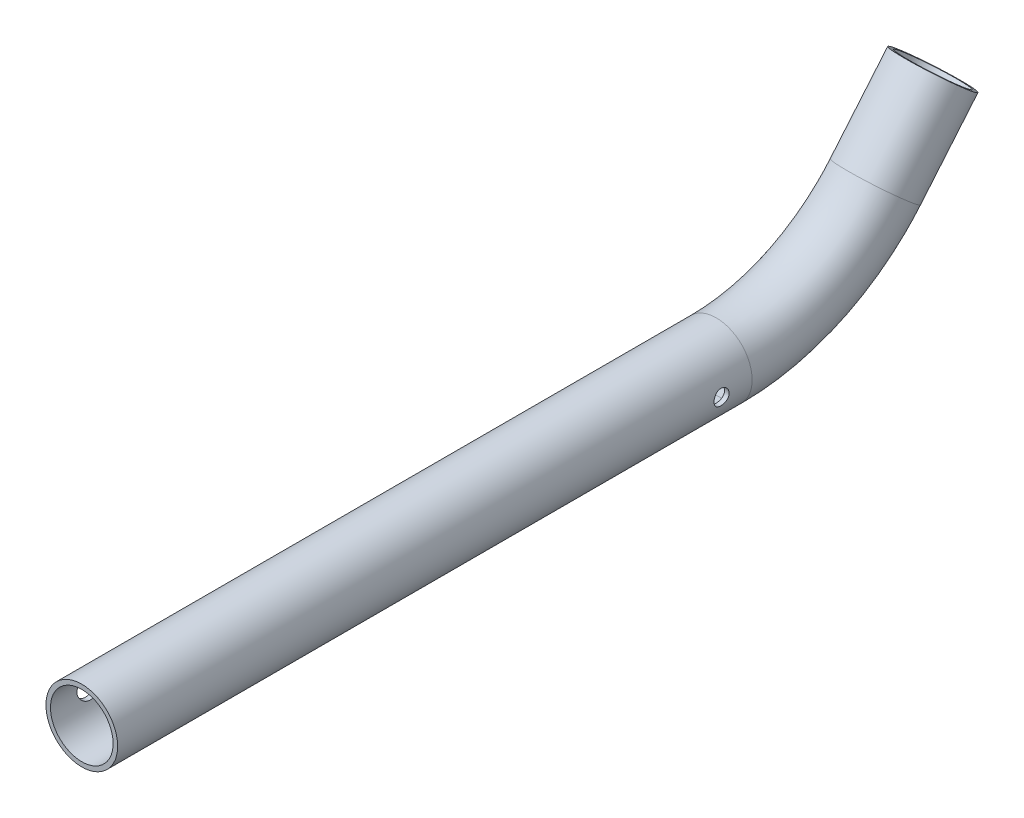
ISO-10303-21;
HEADER;
FILE_DESCRIPTION(('STEP AP214'),'2;1');
FILE_NAME('part.step','',(''),(''),'','','');
FILE_SCHEMA(('AUTOMOTIVE_DESIGN { 1 0 10303 214 1 1 1 1 }'));
ENDSEC;
DATA;
#1=APPLICATION_CONTEXT('core data for automotive mechanical design processes');
#2=APPLICATION_PROTOCOL_DEFINITION('international standard','automotive_design',2000,#1);
#3=PRODUCT_CONTEXT('',#1,'mechanical');
#4=PRODUCT('Part','Part','',(#3));
#5=PRODUCT_RELATED_PRODUCT_CATEGORY('part','',(#4));
#6=PRODUCT_DEFINITION_FORMATION('','',#4);
#7=PRODUCT_DEFINITION_CONTEXT('part definition',#1,'design');
#8=PRODUCT_DEFINITION('design','',#6,#7);
#9=PRODUCT_DEFINITION_SHAPE('','',#8);
#10=(LENGTH_UNIT() NAMED_UNIT(*) SI_UNIT(.MILLI.,.METRE.));
#11=(NAMED_UNIT(*) PLANE_ANGLE_UNIT() SI_UNIT($,.RADIAN.));
#12=(NAMED_UNIT(*) SI_UNIT($,.STERADIAN.) SOLID_ANGLE_UNIT());
#13=UNCERTAINTY_MEASURE_WITH_UNIT(LENGTH_MEASURE(1.E-05),#10,'distance_accuracy_value','');
#14=(GEOMETRIC_REPRESENTATION_CONTEXT(3) GLOBAL_UNCERTAINTY_ASSIGNED_CONTEXT((#13)) GLOBAL_UNIT_ASSIGNED_CONTEXT((#10,
#11,#12)) REPRESENTATION_CONTEXT('',''));
#15=CARTESIAN_POINT('',(0.,0.,0.));
#16=DIRECTION('',(0.,0.,1.));
#17=DIRECTION('',(1.,0.,0.));
#18=AXIS2_PLACEMENT_3D('',#15,#16,#17);
#19=CARTESIAN_POINT('',(0.,19.6466814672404,-210.217557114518));
#20=DIRECTION('',(0.,0.76604444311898,-0.642787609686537));
#21=DIRECTION('',(0.,0.642787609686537,0.76604444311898));
#22=AXIS2_PLACEMENT_3D('',#19,#20,#21);
#23=CYLINDRICAL_SURFACE('',#22,8.30000000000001);
#24=CARTESIAN_POINT('',(0.,37.8,-225.45));
#25=DIRECTION('',(0.,0.76604444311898,-0.642787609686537));
#26=DIRECTION('',(0.,0.642787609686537,0.76604444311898));
#27=AXIS2_PLACEMENT_3D('',#24,#25,#26);
#28=CIRCLE('',#27,8.30000000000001);
#29=CARTESIAN_POINT('',(0.,43.1351371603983,-219.091831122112));
#30=VERTEX_POINT('',#29);
#31=EDGE_CURVE('E17',#30,#30,#28,.T.);
#32=ORIENTED_EDGE('',*,*,#31,.T.);
#33=EDGE_LOOP('',(#32));
#34=FACE_BOUND('',#33,.T.);
#35=CARTESIAN_POINT('',(0.,19.6466814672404,-210.217557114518));
#36=DIRECTION('',(0.,0.76604444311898,-0.642787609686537));
#37=DIRECTION('',(0.,-0.642787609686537,-0.76604444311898));
#38=AXIS2_PLACEMENT_3D('',#35,#36,#37);
#39=CIRCLE('',#38,8.3);
#40=CARTESIAN_POINT('',(0.,14.3115443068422,-216.575725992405));
#41=VERTEX_POINT('',#40);
#42=EDGE_CURVE('E34',#41,#41,#39,.F.);
#43=ORIENTED_EDGE('',*,*,#42,.T.);
#44=EDGE_LOOP('',(#43));
#45=FACE_BOUND('',#44,.T.);
#46=ADVANCED_FACE('F14',(#34,#45),#23,.F.);
#47=CARTESIAN_POINT('',(0.,37.8,-225.45));
#48=DIRECTION('',(0.,-0.766044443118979,0.642787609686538));
#49=DIRECTION('',(0.,-0.642787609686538,-0.766044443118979));
#50=AXIS2_PLACEMENT_3D('',#47,#48,#49);
#51=PLANE('',#50);
#52=CARTESIAN_POINT('',(0.,37.8,-225.45));
#53=DIRECTION('',(0.,0.76604444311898,-0.642787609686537));
#54=DIRECTION('',(0.,0.642787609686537,0.76604444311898));
#55=AXIS2_PLACEMENT_3D('',#52,#53,#54);
#56=CIRCLE('',#55,9.50000000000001);
#57=CARTESIAN_POINT('',(0.,43.9064822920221,-218.17257779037));
#58=VERTEX_POINT('',#57);
#59=EDGE_CURVE('E146',#58,#58,#56,.F.);
#60=ORIENTED_EDGE('',*,*,#59,.F.);
#61=EDGE_LOOP('',(#60));
#62=FACE_BOUND('',#61,.T.);
#63=ORIENTED_EDGE('',*,*,#31,.F.);
#64=EDGE_LOOP('',(#63));
#65=FACE_BOUND('',#64,.T.);
#66=ADVANCED_FACE('F150',(#62,#65),#51,.F.);
#67=CARTESIAN_POINT('',(0.,55.,-168.085112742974));
#68=DIRECTION('',(1.,0.,0.));
#69=DIRECTION('',(0.,0.,-1.));
#70=AXIS2_PLACEMENT_3D('',#67,#68,#69);
#71=TOROIDAL_SURFACE('',#70,55.,8.3);
#72=ORIENTED_EDGE('',*,*,#42,.F.);
#73=EDGE_LOOP('',(#72));
#74=FACE_BOUND('',#73,.T.);
#75=CARTESIAN_POINT('',(0.,0.,-168.085112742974));
#76=DIRECTION('',(0.,0.,1.));
#77=DIRECTION('',(1.,0.,0.));
#78=AXIS2_PLACEMENT_3D('',#75,#76,#77);
#79=CIRCLE('',#78,8.3);
#80=CARTESIAN_POINT('',(8.3,0.,-168.085112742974));
#81=VERTEX_POINT('',#80);
#82=EDGE_CURVE('E144',#81,#81,#79,.T.);
#83=ORIENTED_EDGE('',*,*,#82,.T.);
#84=EDGE_LOOP('',(#83));
#85=FACE_BOUND('',#84,.T.);
#86=ADVANCED_FACE('F148',(#74,#85),#71,.F.);
#87=CARTESIAN_POINT('',(0.,19.6466814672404,-210.217557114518));
#88=DIRECTION('',(0.,0.76604444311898,-0.642787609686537));
#89=DIRECTION('',(0.,0.642787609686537,0.76604444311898));
#90=AXIS2_PLACEMENT_3D('',#87,#88,#89);
#91=CYLINDRICAL_SURFACE('',#90,9.50000000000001);
#92=CARTESIAN_POINT('',(0.,19.6466814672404,-210.217557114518));
#93=DIRECTION('',(0.,0.766044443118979,-0.642787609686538));
#94=DIRECTION('',(0.,-0.642787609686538,-0.766044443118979));
#95=AXIS2_PLACEMENT_3D('',#92,#93,#94);
#96=CIRCLE('',#95,9.5);
#97=CARTESIAN_POINT('',(0.,13.5401991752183,-217.494979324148));
#98=VERTEX_POINT('',#97);
#99=EDGE_CURVE('E141',#98,#98,#96,.F.);
#100=ORIENTED_EDGE('',*,*,#99,.F.);
#101=EDGE_LOOP('',(#100));
#102=FACE_BOUND('',#101,.T.);
#103=ORIENTED_EDGE('',*,*,#59,.T.);
#104=EDGE_LOOP('',(#103));
#105=FACE_BOUND('',#104,.T.);
#106=ADVANCED_FACE('F98',(#102,#105),#91,.T.);
#107=CARTESIAN_POINT('',(0.,0.,-168.085112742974));
#108=DIRECTION('',(0.,0.,1.));
#109=DIRECTION('',(1.,0.,0.));
#110=AXIS2_PLACEMENT_3D('',#107,#108,#109);
#111=CYLINDRICAL_SURFACE('',#110,8.3);
#112=CARTESIAN_POINT('',(-8.3,0.,-62.));
#113=CARTESIAN_POINT('',(-8.29999202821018,0.162635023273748,-62.0000110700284));
#114=CARTESIAN_POINT('',(-8.29516801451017,0.325435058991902,-62.0132890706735));
#115=CARTESIAN_POINT('',(-8.27636202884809,0.646363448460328,-62.065933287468));
#116=CARTESIAN_POINT('',(-8.26236564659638,0.804484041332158,-62.1053405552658));
#117=CARTESIAN_POINT('',(-8.2267356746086,1.11111971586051,-62.2086711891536));
#118=CARTESIAN_POINT('',(-8.20512122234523,1.25965777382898,-62.2725331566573));
#119=CARTESIAN_POINT('',(-8.15642927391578,1.54385169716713,-62.4227204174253));
#120=CARTESIAN_POINT('',(-8.12935218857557,1.67950853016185,-62.5090440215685));
#121=CARTESIAN_POINT('',(-8.07133328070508,1.93958161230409,-62.7053296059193));
#122=CARTESIAN_POINT('',(-8.0402872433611,2.06341545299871,-62.8160322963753));
#123=CARTESIAN_POINT('',(-7.97836136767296,2.29122536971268,-63.0563650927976));
#124=CARTESIAN_POINT('',(-7.94748158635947,2.39519500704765,-63.1860013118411));
#125=CARTESIAN_POINT('',(-7.88820139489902,2.58387696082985,-63.4660329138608));
#126=CARTESIAN_POINT('',(-7.85992483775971,2.66779221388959,-63.6169941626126));
#127=CARTESIAN_POINT('',(-7.81065520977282,2.80878709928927,-63.9320715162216));
#128=CARTESIAN_POINT('',(-7.78965944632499,2.86587665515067,-64.0961827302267));
#129=CARTESIAN_POINT('',(-7.75843293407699,2.94934688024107,-64.4262447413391));
#130=CARTESIAN_POINT('',(-7.74781759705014,2.9768288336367,-64.591879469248));
#131=CARTESIAN_POINT('',(-7.73742399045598,3.00374747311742,-64.9257233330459));
#132=CARTESIAN_POINT('',(-7.73764163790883,3.00319472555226,-65.0939314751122));
#133=CARTESIAN_POINT('',(-7.74855592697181,2.97490609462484,-65.4183113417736));
#134=CARTESIAN_POINT('',(-7.75867589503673,2.94866610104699,-65.5746364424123));
#135=CARTESIAN_POINT('',(-7.78730121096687,2.87220976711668,-65.8804938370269));
#136=CARTESIAN_POINT('',(-7.80580776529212,2.82198997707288,-66.0300251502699));
#137=CARTESIAN_POINT('',(-7.84948967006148,2.69812439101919,-66.3212182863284));
#138=CARTESIAN_POINT('',(-7.87477943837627,2.62407184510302,-66.462689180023));
#139=CARTESIAN_POINT('',(-7.92913514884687,2.45493236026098,-66.7316364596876));
#140=CARTESIAN_POINT('',(-7.95820214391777,2.3598395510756,-66.859108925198));
#141=CARTESIAN_POINT('',(-8.0190374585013,2.14436468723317,-67.1047577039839));
#142=CARTESIAN_POINT('',(-8.05086158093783,2.02278105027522,-67.2218691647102));
#143=CARTESIAN_POINT('',(-8.11207834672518,1.76131367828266,-67.4343768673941));
#144=CARTESIAN_POINT('',(-8.1414698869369,1.62142171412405,-67.5297632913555));
#145=CARTESIAN_POINT('',(-8.1950332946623,1.32453573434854,-67.6972184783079));
#146=CARTESIAN_POINT('',(-8.21912560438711,1.16732813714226,-67.7689389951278));
#147=CARTESIAN_POINT('',(-8.248855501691,0.923650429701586,-67.855578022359));
#148=CARTESIAN_POINT('',(-8.2576950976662,0.841148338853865,-67.8809613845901));
#149=CARTESIAN_POINT('',(-8.27300710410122,0.674069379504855,-67.9245631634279));
#150=CARTESIAN_POINT('',(-8.27948055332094,0.589493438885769,-67.9427847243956));
#151=CARTESIAN_POINT('',(-8.2897307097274,0.421072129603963,-67.9714998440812));
#152=CARTESIAN_POINT('',(-8.29357105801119,0.337261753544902,-67.9821759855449));
#153=CARTESIAN_POINT('',(-8.29870777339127,0.168982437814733,-67.9964289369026));
#154=CARTESIAN_POINT('',(-8.30000414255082,0.0845134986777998,-68.0000057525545));
#155=CARTESIAN_POINT('',(-8.29999202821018,-0.162635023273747,-67.9999889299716));
#156=CARTESIAN_POINT('',(-8.29516801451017,-0.325435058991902,-67.9867109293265));
#157=CARTESIAN_POINT('',(-8.27636202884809,-0.646363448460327,-67.934066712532));
#158=CARTESIAN_POINT('',(-8.26236564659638,-0.804484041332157,-67.8946594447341));
#159=CARTESIAN_POINT('',(-8.2267356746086,-1.11111971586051,-67.7913288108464));
#160=CARTESIAN_POINT('',(-8.20512122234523,-1.25965777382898,-67.7274668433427));
#161=CARTESIAN_POINT('',(-8.15642927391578,-1.54385169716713,-67.5772795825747));
#162=CARTESIAN_POINT('',(-8.12935218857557,-1.67950853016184,-67.4909559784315));
#163=CARTESIAN_POINT('',(-8.07133328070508,-1.93958161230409,-67.2946703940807));
#164=CARTESIAN_POINT('',(-8.0402872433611,-2.06341545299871,-67.1839677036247));
#165=CARTESIAN_POINT('',(-7.97836136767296,-2.29122536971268,-66.9436349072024));
#166=CARTESIAN_POINT('',(-7.94748158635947,-2.39519500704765,-66.8139986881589));
#167=CARTESIAN_POINT('',(-7.88820139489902,-2.58387696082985,-66.5339670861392));
#168=CARTESIAN_POINT('',(-7.85992483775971,-2.66779221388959,-66.3830058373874));
#169=CARTESIAN_POINT('',(-7.81065520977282,-2.80878709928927,-66.0679284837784));
#170=CARTESIAN_POINT('',(-7.78965944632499,-2.86587665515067,-65.9038172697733));
#171=CARTESIAN_POINT('',(-7.75843293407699,-2.94934688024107,-65.5737552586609));
#172=CARTESIAN_POINT('',(-7.74781759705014,-2.9768288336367,-65.408120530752));
#173=CARTESIAN_POINT('',(-7.73742399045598,-3.00374747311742,-65.0742766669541));
#174=CARTESIAN_POINT('',(-7.73764163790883,-3.00319472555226,-64.9060685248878));
#175=CARTESIAN_POINT('',(-7.74855592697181,-2.97490609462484,-64.5816886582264));
#176=CARTESIAN_POINT('',(-7.75867589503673,-2.94866610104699,-64.4253635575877));
#177=CARTESIAN_POINT('',(-7.78730121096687,-2.87220976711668,-64.1195061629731));
#178=CARTESIAN_POINT('',(-7.80580776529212,-2.82198997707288,-63.9699748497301));
#179=CARTESIAN_POINT('',(-7.84948967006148,-2.69812439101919,-63.6787817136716));
#180=CARTESIAN_POINT('',(-7.87477943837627,-2.62407184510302,-63.537310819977));
#181=CARTESIAN_POINT('',(-7.92913514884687,-2.45493236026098,-63.2683635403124));
#182=CARTESIAN_POINT('',(-7.95820214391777,-2.3598395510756,-63.140891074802));
#183=CARTESIAN_POINT('',(-8.0190374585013,-2.14436468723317,-62.8952422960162));
#184=CARTESIAN_POINT('',(-8.05086158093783,-2.02278105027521,-62.7781308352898));
#185=CARTESIAN_POINT('',(-8.11207834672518,-1.76131367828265,-62.5656231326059));
#186=CARTESIAN_POINT('',(-8.1414698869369,-1.62142171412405,-62.4702367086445));
#187=CARTESIAN_POINT('',(-8.1950332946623,-1.32453573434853,-62.3027815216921));
#188=CARTESIAN_POINT('',(-8.21912560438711,-1.16732813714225,-62.2310610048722));
#189=CARTESIAN_POINT('',(-8.248855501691,-0.923650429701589,-62.144421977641));
#190=CARTESIAN_POINT('',(-8.2576950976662,-0.84114833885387,-62.1190386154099));
#191=CARTESIAN_POINT('',(-8.27300710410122,-0.674069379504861,-62.0754368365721));
#192=CARTESIAN_POINT('',(-8.27948055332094,-0.589493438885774,-62.0572152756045));
#193=CARTESIAN_POINT('',(-8.2897307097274,-0.421072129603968,-62.0285001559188));
#194=CARTESIAN_POINT('',(-8.29357105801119,-0.337261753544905,-62.0178240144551));
#195=CARTESIAN_POINT('',(-8.29870777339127,-0.168982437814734,-62.0035710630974));
#196=CARTESIAN_POINT('',(-8.30000414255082,-0.0845134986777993,-61.9999942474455));
#197=CARTESIAN_POINT('',(-8.3,0.,-62.));
#198=B_SPLINE_CURVE_WITH_KNOTS('',3,(#112,#113,#114,#115,#116,#117,#118,#119,#120,#121,#122,
#123,#124,#125,#126,#127,#128,#129,#130,#131,#132,#133,#134,#135,#136,#137,#138,#139,#140,#141,
#142,#143,#144,#145,#146,#147,#148,#149,#150,#151,#152,#153,#154,#155,#156,#157,#158,#159,#160,
#161,#162,#163,#164,#165,#166,#167,#168,#169,#170,#171,#172,#173,#174,#175,#176,#177,#178,#179,
#180,#181,#182,#183,#184,#185,#186,#187,#188,#189,#190,#191,#192,#193,#194,#195,#196,#197),
.UNSPECIFIED.,.T.,.F.,(4,2,2,2,2,2,2,2,2,2,2,2,2,2,2,2,2,2,2,2,2,2,2,2,2,2,2,2,2,2,2,2,2,2,2,2,
2,2,2,2,2,2,4),(0.,0.487591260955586,0.975950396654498,1.4630913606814,1.95019570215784,
2.45488066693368,2.95972894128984,3.48216493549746,4.00440751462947,4.50647202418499,
5.00834730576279,5.48263519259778,5.95699133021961,6.43991557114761,6.92297471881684,
7.43595440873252,7.94916546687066,8.46962273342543,8.72964167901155,8.98954633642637,
9.24292396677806,9.49630139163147,9.98389265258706,10.472251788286,10.9593927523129,
11.4464970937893,11.9511820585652,12.4560303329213,12.9784663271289,13.5007089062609,
14.0027734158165,14.5046486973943,14.9789365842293,15.4532927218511,15.9362169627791,
16.4192761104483,16.932255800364,17.4454668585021,17.9659241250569,18.225943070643,
18.4858477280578,18.7392253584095,18.9926027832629),.UNSPECIFIED.);
#199=CARTESIAN_POINT('',(-8.3,0.,-62.));
#200=VERTEX_POINT('',#199);
#201=EDGE_CURVE('E76',#200,#200,#198,.T.);
#202=ORIENTED_EDGE('',*,*,#201,.T.);
#203=EDGE_LOOP('',(#202));
#204=FACE_BOUND('',#203,.T.);
#205=CARTESIAN_POINT('',(-8.3,0.,-7.));
#206=CARTESIAN_POINT('',(-8.29999202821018,0.162635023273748,-7.00001107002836));
#207=CARTESIAN_POINT('',(-8.29516801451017,0.325435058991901,-7.01328907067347));
#208=CARTESIAN_POINT('',(-8.27636202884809,0.646363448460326,-7.06593328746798));
#209=CARTESIAN_POINT('',(-8.26236564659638,0.804484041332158,-7.10534055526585));
#210=CARTESIAN_POINT('',(-8.2267356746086,1.11111971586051,-7.20867118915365));
#211=CARTESIAN_POINT('',(-8.20512122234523,1.25965777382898,-7.27253315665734));
#212=CARTESIAN_POINT('',(-8.15642927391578,1.54385169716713,-7.42272041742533));
#213=CARTESIAN_POINT('',(-8.12935218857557,1.67950853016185,-7.50904402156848));
#214=CARTESIAN_POINT('',(-8.07133328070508,1.93958161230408,-7.70532960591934));
#215=CARTESIAN_POINT('',(-8.0402872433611,2.0634154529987,-7.81603229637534));
#216=CARTESIAN_POINT('',(-7.97836136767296,2.29122536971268,-8.05636509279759));
#217=CARTESIAN_POINT('',(-7.94748158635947,2.39519500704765,-8.18600131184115));
#218=CARTESIAN_POINT('',(-7.88820139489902,2.58387696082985,-8.46603291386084));
#219=CARTESIAN_POINT('',(-7.85992483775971,2.66779221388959,-8.61699416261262));
#220=CARTESIAN_POINT('',(-7.81065520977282,2.80878709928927,-8.93207151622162));
#221=CARTESIAN_POINT('',(-7.78965944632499,2.86587665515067,-9.09618273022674));
#222=CARTESIAN_POINT('',(-7.75843293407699,2.94934688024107,-9.42624474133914));
#223=CARTESIAN_POINT('',(-7.74781759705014,2.9768288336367,-9.59187946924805));
#224=CARTESIAN_POINT('',(-7.73742399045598,3.00374747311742,-9.92572333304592));
#225=CARTESIAN_POINT('',(-7.73764163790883,3.00319472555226,-10.0939314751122));
#226=CARTESIAN_POINT('',(-7.74855592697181,2.97490609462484,-10.4183113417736));
#227=CARTESIAN_POINT('',(-7.75867589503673,2.94866610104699,-10.5746364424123));
#228=CARTESIAN_POINT('',(-7.78730121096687,2.87220976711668,-10.8804938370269));
#229=CARTESIAN_POINT('',(-7.80580776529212,2.82198997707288,-11.0300251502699));
#230=CARTESIAN_POINT('',(-7.84948967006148,2.69812439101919,-11.3212182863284));
#231=CARTESIAN_POINT('',(-7.87477943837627,2.62407184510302,-11.462689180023));
#232=CARTESIAN_POINT('',(-7.92913514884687,2.45493236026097,-11.7316364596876));
#233=CARTESIAN_POINT('',(-7.95820214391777,2.35983955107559,-11.859108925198));
#234=CARTESIAN_POINT('',(-8.0190374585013,2.14436468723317,-12.1047577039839));
#235=CARTESIAN_POINT('',(-8.05086158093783,2.02278105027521,-12.2218691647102));
#236=CARTESIAN_POINT('',(-8.11207834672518,1.76131367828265,-12.4343768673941));
#237=CARTESIAN_POINT('',(-8.1414698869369,1.62142171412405,-12.5297632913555));
#238=CARTESIAN_POINT('',(-8.1950332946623,1.32453573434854,-12.6972184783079));
#239=CARTESIAN_POINT('',(-8.21912560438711,1.16732813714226,-12.7689389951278));
#240=CARTESIAN_POINT('',(-8.248855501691,0.92365042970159,-12.855578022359));
#241=CARTESIAN_POINT('',(-8.2576950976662,0.84114833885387,-12.8809613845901));
#242=CARTESIAN_POINT('',(-8.27300710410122,0.674069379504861,-12.9245631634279));
#243=CARTESIAN_POINT('',(-8.27948055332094,0.589493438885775,-12.9427847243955));
#244=CARTESIAN_POINT('',(-8.2897307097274,0.42107212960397,-12.9714998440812));
#245=CARTESIAN_POINT('',(-8.29357105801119,0.337261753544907,-12.9821759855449));
#246=CARTESIAN_POINT('',(-8.29870777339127,0.168982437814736,-12.9964289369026));
#247=CARTESIAN_POINT('',(-8.30000414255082,0.0845134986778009,-13.0000057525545));
#248=CARTESIAN_POINT('',(-8.29999202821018,-0.162635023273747,-12.9999889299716));
#249=CARTESIAN_POINT('',(-8.29516801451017,-0.3254350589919,-12.9867109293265));
#250=CARTESIAN_POINT('',(-8.27636202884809,-0.646363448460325,-12.934066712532));
#251=CARTESIAN_POINT('',(-8.26236564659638,-0.804484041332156,-12.8946594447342));
#252=CARTESIAN_POINT('',(-8.2267356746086,-1.11111971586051,-12.7913288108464));
#253=CARTESIAN_POINT('',(-8.20512122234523,-1.25965777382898,-12.7274668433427));
#254=CARTESIAN_POINT('',(-8.15642927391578,-1.54385169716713,-12.5772795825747));
#255=CARTESIAN_POINT('',(-8.12935218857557,-1.67950853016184,-12.4909559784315));
#256=CARTESIAN_POINT('',(-8.07133328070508,-1.93958161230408,-12.2946703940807));
#257=CARTESIAN_POINT('',(-8.0402872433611,-2.0634154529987,-12.1839677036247));
#258=CARTESIAN_POINT('',(-7.97836136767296,-2.29122536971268,-11.9436349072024));
#259=CARTESIAN_POINT('',(-7.94748158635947,-2.39519500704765,-11.8139986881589));
#260=CARTESIAN_POINT('',(-7.88820139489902,-2.58387696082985,-11.5339670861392));
#261=CARTESIAN_POINT('',(-7.85992483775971,-2.66779221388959,-11.3830058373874));
#262=CARTESIAN_POINT('',(-7.81065520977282,-2.80878709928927,-11.0679284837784));
#263=CARTESIAN_POINT('',(-7.78965944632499,-2.86587665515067,-10.9038172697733));
#264=CARTESIAN_POINT('',(-7.75843293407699,-2.94934688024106,-10.5737552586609));
#265=CARTESIAN_POINT('',(-7.74781759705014,-2.9768288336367,-10.408120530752));
#266=CARTESIAN_POINT('',(-7.73742399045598,-3.00374747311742,-10.0742766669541));
#267=CARTESIAN_POINT('',(-7.73764163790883,-3.00319472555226,-9.90606852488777));
#268=CARTESIAN_POINT('',(-7.74855592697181,-2.97490609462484,-9.58168865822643));
#269=CARTESIAN_POINT('',(-7.75867589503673,-2.94866610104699,-9.4253635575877));
#270=CARTESIAN_POINT('',(-7.78730121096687,-2.87220976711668,-9.11950616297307));
#271=CARTESIAN_POINT('',(-7.80580776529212,-2.82198997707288,-8.96997484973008));
#272=CARTESIAN_POINT('',(-7.84948967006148,-2.69812439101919,-8.67878171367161));
#273=CARTESIAN_POINT('',(-7.87477943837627,-2.62407184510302,-8.53731081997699));
#274=CARTESIAN_POINT('',(-7.92913514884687,-2.45493236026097,-8.26836354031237));
#275=CARTESIAN_POINT('',(-7.95820214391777,-2.35983955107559,-8.14089107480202));
#276=CARTESIAN_POINT('',(-8.0190374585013,-2.14436468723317,-7.89524229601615));
#277=CARTESIAN_POINT('',(-8.05086158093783,-2.02278105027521,-7.77813083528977));
#278=CARTESIAN_POINT('',(-8.11207834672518,-1.76131367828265,-7.56562313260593));
#279=CARTESIAN_POINT('',(-8.1414698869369,-1.62142171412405,-7.4702367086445));
#280=CARTESIAN_POINT('',(-8.1950332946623,-1.32453573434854,-7.30278152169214));
#281=CARTESIAN_POINT('',(-8.2191256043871,-1.16732813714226,-7.23106100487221));
#282=CARTESIAN_POINT('',(-8.248855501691,-0.92365042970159,-7.14442197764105));
#283=CARTESIAN_POINT('',(-8.2576950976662,-0.84114833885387,-7.11903861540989));
#284=CARTESIAN_POINT('',(-8.27300710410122,-0.674069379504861,-7.07543683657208));
#285=CARTESIAN_POINT('',(-8.27948055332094,-0.589493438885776,-7.05721527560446));
#286=CARTESIAN_POINT('',(-8.2897307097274,-0.421072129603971,-7.0285001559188));
#287=CARTESIAN_POINT('',(-8.29357105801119,-0.337261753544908,-7.01782401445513));
#288=CARTESIAN_POINT('',(-8.29870777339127,-0.168982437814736,-7.0035710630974));
#289=CARTESIAN_POINT('',(-8.30000414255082,-0.0845134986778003,-6.99999424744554));
#290=CARTESIAN_POINT('',(-8.3,0.,-7.));
#291=B_SPLINE_CURVE_WITH_KNOTS('',3,(#205,#206,#207,#208,#209,#210,#211,#212,#213,#214,#215,
#216,#217,#218,#219,#220,#221,#222,#223,#224,#225,#226,#227,#228,#229,#230,#231,#232,#233,#234,
#235,#236,#237,#238,#239,#240,#241,#242,#243,#244,#245,#246,#247,#248,#249,#250,#251,#252,#253,
#254,#255,#256,#257,#258,#259,#260,#261,#262,#263,#264,#265,#266,#267,#268,#269,#270,#271,#272,
#273,#274,#275,#276,#277,#278,#279,#280,#281,#282,#283,#284,#285,#286,#287,#288,#289,#290),
.UNSPECIFIED.,.T.,.F.,(4,2,2,2,2,2,2,2,2,2,2,2,2,2,2,2,2,2,2,2,2,2,2,2,2,2,2,2,2,2,2,2,2,2,2,2,
2,2,2,2,2,2,4),(0.,0.487591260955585,0.975950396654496,1.46309136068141,1.95019570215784,
2.45488066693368,2.95972894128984,3.48216493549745,4.00440751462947,4.50647202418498,
5.00834730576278,5.48263519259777,5.95699133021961,6.43991557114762,6.92297471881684,
7.43595440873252,7.94916546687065,8.46962273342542,8.72964167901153,8.98954633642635,
9.24292396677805,9.49630139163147,9.98389265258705,10.472251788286,10.9593927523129,
11.4464970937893,11.9511820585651,12.4560303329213,12.9784663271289,13.5007089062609,
14.0027734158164,14.5046486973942,14.9789365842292,15.4532927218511,15.9362169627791,
16.4192761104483,16.932255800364,17.4454668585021,17.9659241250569,18.225943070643,
18.4858477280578,18.7392253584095,18.9926027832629),.UNSPECIFIED.);
#292=CARTESIAN_POINT('',(-8.3,0.,-7.));
#293=VERTEX_POINT('',#292);
#294=EDGE_CURVE('E84',#293,#293,#291,.T.);
#295=ORIENTED_EDGE('',*,*,#294,.T.);
#296=EDGE_LOOP('',(#295));
#297=FACE_BOUND('',#296,.T.);
#298=CARTESIAN_POINT('',(0.,0.,0.));
#299=DIRECTION('',(0.,0.,1.));
#300=DIRECTION('',(1.,0.,0.));
#301=AXIS2_PLACEMENT_3D('',#298,#299,#300);
#302=CIRCLE('',#301,8.3);
#303=CARTESIAN_POINT('',(8.3,0.,0.));
#304=VERTEX_POINT('',#303);
#305=EDGE_CURVE('E111',#304,#304,#302,.F.);
#306=ORIENTED_EDGE('',*,*,#305,.F.);
#307=EDGE_LOOP('',(#306));
#308=FACE_BOUND('',#307,.T.);
#309=CARTESIAN_POINT('',(8.3,0.,-162.));
#310=CARTESIAN_POINT('',(8.29999684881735,0.11050363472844,-161.999994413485));
#311=CARTESIAN_POINT('',(8.29776860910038,0.221138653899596,-161.990801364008));
#312=CARTESIAN_POINT('',(8.28908655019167,0.439343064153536,-161.954292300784));
#313=CARTESIAN_POINT('',(8.2826246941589,0.546906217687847,-161.926941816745));
#314=CARTESIAN_POINT('',(8.26619325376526,0.755639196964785,-161.855038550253));
#315=CARTESIAN_POINT('',(8.25622948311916,0.856819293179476,-161.81051426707));
#316=CARTESIAN_POINT('',(8.23386222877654,1.05024004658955,-161.70560926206));
#317=CARTESIAN_POINT('',(8.22145940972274,1.14248312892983,-161.64523285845));
#318=CARTESIAN_POINT('',(8.19529386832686,1.31723523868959,-161.509095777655));
#319=CARTESIAN_POINT('',(8.18151125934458,1.39954725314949,-161.433085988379));
#320=CARTESIAN_POINT('',(8.15427351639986,1.55039101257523,-161.268369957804));
#321=CARTESIAN_POINT('',(8.14081843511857,1.6189205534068,-161.179661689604));
#322=CARTESIAN_POINT('',(8.11556257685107,1.74115049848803,-160.990574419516));
#323=CARTESIAN_POINT('',(8.10378691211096,1.7946355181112,-160.890052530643));
#324=CARTESIAN_POINT('',(8.0835096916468,1.88387351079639,-160.681116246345));
#325=CARTESIAN_POINT('',(8.07500762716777,1.91962923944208,-160.572703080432));
#326=CARTESIAN_POINT('',(8.06244260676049,1.97173298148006,-160.353204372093));
#327=CARTESIAN_POINT('',(8.05829964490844,1.98843127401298,-160.24220666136));
#328=CARTESIAN_POINT('',(8.05468220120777,2.00303663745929,-160.018913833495));
#329=CARTESIAN_POINT('',(8.05520702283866,2.00094651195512,-159.906618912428));
#330=CARTESIAN_POINT('',(8.06079376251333,1.97831461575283,-159.686580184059));
#331=CARTESIAN_POINT('',(8.06575379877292,1.95818715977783,-159.578790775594));
#332=CARTESIAN_POINT('',(8.07949017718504,1.90071125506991,-159.368164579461));
#333=CARTESIAN_POINT('',(8.08826679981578,1.86336154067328,-159.265328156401));
#334=CARTESIAN_POINT('',(8.10874332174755,1.77213885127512,-159.066397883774));
#335=CARTESIAN_POINT('',(8.12047018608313,1.71811235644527,-158.970377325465));
#336=CARTESIAN_POINT('',(8.14550922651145,1.5951811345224,-158.788621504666));
#337=CARTESIAN_POINT('',(8.15882155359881,1.52627498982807,-158.702887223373));
#338=CARTESIAN_POINT('',(8.18596135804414,1.37339308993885,-158.541766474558));
#339=CARTESIAN_POINT('',(8.19979318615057,1.28906930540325,-158.466710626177));
#340=CARTESIAN_POINT('',(8.22610359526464,1.10882871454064,-158.331713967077));
#341=CARTESIAN_POINT('',(8.238581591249,1.01290693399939,-158.271779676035));
#342=CARTESIAN_POINT('',(8.26083516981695,0.811715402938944,-158.168620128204));
#343=CARTESIAN_POINT('',(8.27060039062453,0.706411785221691,-158.125458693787));
#344=CARTESIAN_POINT('',(8.28623719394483,0.489886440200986,-158.057622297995));
#345=CARTESIAN_POINT('',(8.29211689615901,0.378677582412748,-158.03290877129));
#346=CARTESIAN_POINT('',(8.29714549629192,0.222138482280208,-158.011874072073));
#347=CARTESIAN_POINT('',(8.29821334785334,0.177840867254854,-158.007425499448));
#348=CARTESIAN_POINT('',(8.29964123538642,0.0890359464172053,-158.001487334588));
#349=CARTESIAN_POINT('',(8.30000126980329,0.0445286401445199,-157.999997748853));
#350=CARTESIAN_POINT('',(8.29999684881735,-0.110503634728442,-158.000005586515));
#351=CARTESIAN_POINT('',(8.29776860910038,-0.221138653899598,-158.009198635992));
#352=CARTESIAN_POINT('',(8.28908655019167,-0.439343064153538,-158.045707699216));
#353=CARTESIAN_POINT('',(8.2826246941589,-0.546906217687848,-158.073058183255));
#354=CARTESIAN_POINT('',(8.26619325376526,-0.755639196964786,-158.144961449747));
#355=CARTESIAN_POINT('',(8.25622948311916,-0.856819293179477,-158.18948573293));
#356=CARTESIAN_POINT('',(8.23386222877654,-1.05024004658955,-158.29439073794));
#357=CARTESIAN_POINT('',(8.22145940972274,-1.14248312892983,-158.35476714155));
#358=CARTESIAN_POINT('',(8.19529386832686,-1.31723523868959,-158.490904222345));
#359=CARTESIAN_POINT('',(8.18151125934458,-1.3995472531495,-158.566914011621));
#360=CARTESIAN_POINT('',(8.15427351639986,-1.55039101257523,-158.731630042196));
#361=CARTESIAN_POINT('',(8.14081843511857,-1.6189205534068,-158.820338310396));
#362=CARTESIAN_POINT('',(8.11556257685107,-1.74115049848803,-159.009425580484));
#363=CARTESIAN_POINT('',(8.10378691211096,-1.7946355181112,-159.109947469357));
#364=CARTESIAN_POINT('',(8.0835096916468,-1.88387351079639,-159.318883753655));
#365=CARTESIAN_POINT('',(8.07500762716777,-1.91962923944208,-159.427296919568));
#366=CARTESIAN_POINT('',(8.06244260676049,-1.97173298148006,-159.646795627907));
#367=CARTESIAN_POINT('',(8.05829964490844,-1.98843127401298,-159.75779333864));
#368=CARTESIAN_POINT('',(8.05468220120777,-2.00303663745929,-159.981086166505));
#369=CARTESIAN_POINT('',(8.05520702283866,-2.00094651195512,-160.093381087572));
#370=CARTESIAN_POINT('',(8.06079376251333,-1.97831461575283,-160.313419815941));
#371=CARTESIAN_POINT('',(8.06575379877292,-1.95818715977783,-160.421209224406));
#372=CARTESIAN_POINT('',(8.07949017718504,-1.90071125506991,-160.631835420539));
#373=CARTESIAN_POINT('',(8.08826679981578,-1.86336154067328,-160.734671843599));
#374=CARTESIAN_POINT('',(8.10874332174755,-1.77213885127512,-160.933602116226));
#375=CARTESIAN_POINT('',(8.12047018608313,-1.71811235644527,-161.029622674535));
#376=CARTESIAN_POINT('',(8.14550922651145,-1.5951811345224,-161.211378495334));
#377=CARTESIAN_POINT('',(8.15882155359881,-1.52627498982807,-161.297112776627));
#378=CARTESIAN_POINT('',(8.18596135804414,-1.37339308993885,-161.458233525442));
#379=CARTESIAN_POINT('',(8.19979318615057,-1.28906930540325,-161.533289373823));
#380=CARTESIAN_POINT('',(8.22610359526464,-1.10882871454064,-161.668286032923));
#381=CARTESIAN_POINT('',(8.238581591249,-1.01290693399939,-161.728220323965));
#382=CARTESIAN_POINT('',(8.26083516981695,-0.811715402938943,-161.831379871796));
#383=CARTESIAN_POINT('',(8.27060039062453,-0.706411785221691,-161.874541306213));
#384=CARTESIAN_POINT('',(8.28623719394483,-0.489886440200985,-161.942377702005));
#385=CARTESIAN_POINT('',(8.29211689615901,-0.378677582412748,-161.96709122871));
#386=CARTESIAN_POINT('',(8.29714549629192,-0.222138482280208,-161.988125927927));
#387=CARTESIAN_POINT('',(8.29821334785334,-0.177840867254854,-161.992574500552));
#388=CARTESIAN_POINT('',(8.29964123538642,-0.0890359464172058,-161.998512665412));
#389=CARTESIAN_POINT('',(8.30000126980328,-0.0445286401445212,-162.000002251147));
#390=CARTESIAN_POINT('',(8.3,0.,-162.));
#391=B_SPLINE_CURVE_WITH_KNOTS('',3,(#309,#310,#311,#312,#313,#314,#315,#316,#317,#318,#319,
#320,#321,#322,#323,#324,#325,#326,#327,#328,#329,#330,#331,#332,#333,#334,#335,#336,#337,#338,
#339,#340,#341,#342,#343,#344,#345,#346,#347,#348,#349,#350,#351,#352,#353,#354,#355,#356,#357,
#358,#359,#360,#361,#362,#363,#364,#365,#366,#367,#368,#369,#370,#371,#372,#373,#374,#375,#376,
#377,#378,#379,#380,#381,#382,#383,#384,#385,#386,#387,#388,#389,#390),.UNSPECIFIED.,.T.,.F.,(4,
2,2,2,2,2,2,2,2,2,2,2,2,2,2,2,2,2,2,2,2,2,2,2,2,2,2,2,2,2,2,2,2,2,2,2,2,2,2,2,4),(0.,
0.331340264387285,0.663311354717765,0.994733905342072,1.32606626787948,1.66315646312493,
2.00030052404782,2.34205060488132,2.68374755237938,3.01905744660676,3.35431730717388,
3.68206826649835,4.00984331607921,4.34073056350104,4.67164934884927,5.0112528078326,
5.35100243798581,5.6920324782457,6.03234758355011,6.16586444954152,6.2993816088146,
6.63072187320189,6.96269296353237,7.29411551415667,7.62544787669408,7.96253807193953,
8.29968213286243,8.64143221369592,8.98312916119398,9.31843905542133,9.65369891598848,
9.98144987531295,10.3092249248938,10.6401121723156,10.9710309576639,11.3106344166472,
11.6503840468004,11.9914140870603,12.3317291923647,12.4652460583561,12.5987632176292),.UNSPECIFIED.);
#392=CARTESIAN_POINT('',(8.3,0.,-162.));
#393=VERTEX_POINT('',#392);
#394=EDGE_CURVE('E105',#393,#393,#391,.T.);
#395=ORIENTED_EDGE('',*,*,#394,.T.);
#396=EDGE_LOOP('',(#395));
#397=FACE_BOUND('',#396,.T.);
#398=ORIENTED_EDGE('',*,*,#82,.F.);
#399=EDGE_LOOP('',(#398));
#400=FACE_BOUND('',#399,.T.);
#401=CARTESIAN_POINT('',(-8.3,0.,-158.));
#402=CARTESIAN_POINT('',(-8.29999684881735,0.110503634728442,-158.000005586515));
#403=CARTESIAN_POINT('',(-8.29776860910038,0.221138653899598,-158.009198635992));
#404=CARTESIAN_POINT('',(-8.28908655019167,0.439343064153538,-158.045707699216));
#405=CARTESIAN_POINT('',(-8.2826246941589,0.546906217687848,-158.073058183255));
#406=CARTESIAN_POINT('',(-8.26619325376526,0.755639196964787,-158.144961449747));
#407=CARTESIAN_POINT('',(-8.25622948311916,0.856819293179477,-158.18948573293));
#408=CARTESIAN_POINT('',(-8.23386222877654,1.05024004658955,-158.29439073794));
#409=CARTESIAN_POINT('',(-8.22145940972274,1.14248312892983,-158.35476714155));
#410=CARTESIAN_POINT('',(-8.19529386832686,1.3172352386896,-158.490904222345));
#411=CARTESIAN_POINT('',(-8.18151125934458,1.3995472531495,-158.566914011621));
#412=CARTESIAN_POINT('',(-8.15427351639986,1.55039101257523,-158.731630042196));
#413=CARTESIAN_POINT('',(-8.14081843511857,1.6189205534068,-158.820338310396));
#414=CARTESIAN_POINT('',(-8.11556257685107,1.74115049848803,-159.009425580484));
#415=CARTESIAN_POINT('',(-8.10378691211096,1.7946355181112,-159.109947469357));
#416=CARTESIAN_POINT('',(-8.0835096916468,1.88387351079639,-159.318883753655));
#417=CARTESIAN_POINT('',(-8.07500762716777,1.91962923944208,-159.427296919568));
#418=CARTESIAN_POINT('',(-8.06244260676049,1.97173298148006,-159.646795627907));
#419=CARTESIAN_POINT('',(-8.05829964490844,1.98843127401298,-159.75779333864));
#420=CARTESIAN_POINT('',(-8.05468220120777,2.00303663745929,-159.981086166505));
#421=CARTESIAN_POINT('',(-8.05520702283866,2.00094651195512,-160.093381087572));
#422=CARTESIAN_POINT('',(-8.06079376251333,1.97831461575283,-160.313419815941));
#423=CARTESIAN_POINT('',(-8.06575379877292,1.95818715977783,-160.421209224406));
#424=CARTESIAN_POINT('',(-8.07949017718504,1.90071125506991,-160.631835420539));
#425=CARTESIAN_POINT('',(-8.08826679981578,1.86336154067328,-160.734671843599));
#426=CARTESIAN_POINT('',(-8.10874332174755,1.77213885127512,-160.933602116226));
#427=CARTESIAN_POINT('',(-8.12047018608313,1.71811235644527,-161.029622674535));
#428=CARTESIAN_POINT('',(-8.14550922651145,1.5951811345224,-161.211378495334));
#429=CARTESIAN_POINT('',(-8.15882155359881,1.52627498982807,-161.297112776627));
#430=CARTESIAN_POINT('',(-8.18596135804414,1.37339308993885,-161.458233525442));
#431=CARTESIAN_POINT('',(-8.19979318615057,1.28906930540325,-161.533289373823));
#432=CARTESIAN_POINT('',(-8.22610359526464,1.10882871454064,-161.668286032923));
#433=CARTESIAN_POINT('',(-8.238581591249,1.01290693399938,-161.728220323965));
#434=CARTESIAN_POINT('',(-8.26083516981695,0.811715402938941,-161.831379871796));
#435=CARTESIAN_POINT('',(-8.27060039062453,0.706411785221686,-161.874541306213));
#436=CARTESIAN_POINT('',(-8.28623719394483,0.48988644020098,-161.942377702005));
#437=CARTESIAN_POINT('',(-8.29211689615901,0.378677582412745,-161.96709122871));
#438=CARTESIAN_POINT('',(-8.29714549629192,0.222138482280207,-161.988125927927));
#439=CARTESIAN_POINT('',(-8.29821334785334,0.177840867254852,-161.992574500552));
#440=CARTESIAN_POINT('',(-8.29964123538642,0.0890359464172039,-161.998512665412));
#441=CARTESIAN_POINT('',(-8.30000126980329,0.0445286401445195,-162.000002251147));
#442=CARTESIAN_POINT('',(-8.29999684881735,-0.110503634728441,-161.999994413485));
#443=CARTESIAN_POINT('',(-8.29776860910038,-0.221138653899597,-161.990801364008));
#444=CARTESIAN_POINT('',(-8.28908655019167,-0.439343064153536,-161.954292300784));
#445=CARTESIAN_POINT('',(-8.2826246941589,-0.546906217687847,-161.926941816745));
#446=CARTESIAN_POINT('',(-8.26619325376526,-0.755639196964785,-161.855038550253));
#447=CARTESIAN_POINT('',(-8.25622948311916,-0.856819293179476,-161.81051426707));
#448=CARTESIAN_POINT('',(-8.23386222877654,-1.05024004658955,-161.70560926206));
#449=CARTESIAN_POINT('',(-8.22145940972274,-1.14248312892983,-161.64523285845));
#450=CARTESIAN_POINT('',(-8.19529386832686,-1.31723523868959,-161.509095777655));
#451=CARTESIAN_POINT('',(-8.18151125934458,-1.39954725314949,-161.433085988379));
#452=CARTESIAN_POINT('',(-8.15427351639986,-1.55039101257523,-161.268369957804));
#453=CARTESIAN_POINT('',(-8.14081843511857,-1.6189205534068,-161.179661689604));
#454=CARTESIAN_POINT('',(-8.11556257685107,-1.74115049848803,-160.990574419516));
#455=CARTESIAN_POINT('',(-8.10378691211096,-1.7946355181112,-160.890052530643));
#456=CARTESIAN_POINT('',(-8.0835096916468,-1.88387351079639,-160.681116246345));
#457=CARTESIAN_POINT('',(-8.07500762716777,-1.91962923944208,-160.572703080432));
#458=CARTESIAN_POINT('',(-8.06244260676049,-1.97173298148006,-160.353204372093));
#459=CARTESIAN_POINT('',(-8.05829964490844,-1.98843127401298,-160.24220666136));
#460=CARTESIAN_POINT('',(-8.05468220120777,-2.00303663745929,-160.018913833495));
#461=CARTESIAN_POINT('',(-8.05520702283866,-2.00094651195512,-159.906618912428));
#462=CARTESIAN_POINT('',(-8.06079376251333,-1.97831461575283,-159.686580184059));
#463=CARTESIAN_POINT('',(-8.06575379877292,-1.95818715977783,-159.578790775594));
#464=CARTESIAN_POINT('',(-8.07949017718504,-1.90071125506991,-159.368164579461));
#465=CARTESIAN_POINT('',(-8.08826679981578,-1.86336154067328,-159.265328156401));
#466=CARTESIAN_POINT('',(-8.10874332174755,-1.77213885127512,-159.066397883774));
#467=CARTESIAN_POINT('',(-8.12047018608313,-1.71811235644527,-158.970377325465));
#468=CARTESIAN_POINT('',(-8.14550922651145,-1.5951811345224,-158.788621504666));
#469=CARTESIAN_POINT('',(-8.15882155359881,-1.52627498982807,-158.702887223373));
#470=CARTESIAN_POINT('',(-8.18596135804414,-1.37339308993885,-158.541766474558));
#471=CARTESIAN_POINT('',(-8.19979318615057,-1.28906930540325,-158.466710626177));
#472=CARTESIAN_POINT('',(-8.22610359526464,-1.10882871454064,-158.331713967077));
#473=CARTESIAN_POINT('',(-8.238581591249,-1.01290693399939,-158.271779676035));
#474=CARTESIAN_POINT('',(-8.26083516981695,-0.811715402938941,-158.168620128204));
#475=CARTESIAN_POINT('',(-8.27060039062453,-0.706411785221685,-158.125458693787));
#476=CARTESIAN_POINT('',(-8.28623719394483,-0.48988644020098,-158.057622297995));
#477=CARTESIAN_POINT('',(-8.29211689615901,-0.378677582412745,-158.03290877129));
#478=CARTESIAN_POINT('',(-8.29714549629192,-0.222138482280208,-158.011874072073));
#479=CARTESIAN_POINT('',(-8.29821334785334,-0.177840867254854,-158.007425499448));
#480=CARTESIAN_POINT('',(-8.29964123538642,-0.0890359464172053,-158.001487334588));
#481=CARTESIAN_POINT('',(-8.30000126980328,-0.0445286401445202,-157.999997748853));
#482=CARTESIAN_POINT('',(-8.3,0.,-158.));
#483=B_SPLINE_CURVE_WITH_KNOTS('',3,(#401,#402,#403,#404,#405,#406,#407,#408,#409,#410,#411,
#412,#413,#414,#415,#416,#417,#418,#419,#420,#421,#422,#423,#424,#425,#426,#427,#428,#429,#430,
#431,#432,#433,#434,#435,#436,#437,#438,#439,#440,#441,#442,#443,#444,#445,#446,#447,#448,#449,
#450,#451,#452,#453,#454,#455,#456,#457,#458,#459,#460,#461,#462,#463,#464,#465,#466,#467,#468,
#469,#470,#471,#472,#473,#474,#475,#476,#477,#478,#479,#480,#481,#482),.UNSPECIFIED.,.T.,.F.,(4,
2,2,2,2,2,2,2,2,2,2,2,2,2,2,2,2,2,2,2,2,2,2,2,2,2,2,2,2,2,2,2,2,2,2,2,2,2,2,2,4),(0.,
0.331340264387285,0.663311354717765,0.994733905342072,1.32606626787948,1.66315646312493,
2.00030052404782,2.34205060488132,2.68374755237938,3.01905744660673,3.35431730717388,
3.68206826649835,4.00984331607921,4.34073056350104,4.67164934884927,5.0112528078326,
5.35100243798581,5.69203247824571,6.03234758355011,6.16586444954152,6.2993816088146,
6.63072187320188,6.96269296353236,7.29411551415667,7.62544787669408,7.96253807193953,
8.29968213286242,8.64143221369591,8.98312916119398,9.31843905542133,9.65369891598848,
9.98144987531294,10.3092249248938,10.6401121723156,10.9710309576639,11.3106344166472,
11.6503840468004,11.9914140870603,12.3317291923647,12.4652460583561,12.5987632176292),.UNSPECIFIED.);
#484=CARTESIAN_POINT('',(-8.3,0.,-158.));
#485=VERTEX_POINT('',#484);
#486=EDGE_CURVE('E85',#485,#485,#483,.T.);
#487=ORIENTED_EDGE('',*,*,#486,.T.);
#488=EDGE_LOOP('',(#487));
#489=FACE_BOUND('',#488,.T.);
#490=ADVANCED_FACE('F93',(#204,#297,#308,#397,#400,#489),#111,.F.);
#491=CARTESIAN_POINT('',(0.,55.,-168.085112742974));
#492=DIRECTION('',(1.,0.,0.));
#493=DIRECTION('',(0.,0.,-1.));
#494=AXIS2_PLACEMENT_3D('',#491,#492,#493);
#495=TOROIDAL_SURFACE('',#494,55.,9.5);
#496=CARTESIAN_POINT('',(0.,0.,-168.085112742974));
#497=DIRECTION('',(0.,0.,1.));
#498=DIRECTION('',(1.,0.,0.));
#499=AXIS2_PLACEMENT_3D('',#496,#497,#498);
#500=CIRCLE('',#499,9.5);
#501=CARTESIAN_POINT('',(9.5,0.,-168.085112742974));
#502=VERTEX_POINT('',#501);
#503=EDGE_CURVE('E110',#502,#502,#500,.T.);
#504=ORIENTED_EDGE('',*,*,#503,.F.);
#505=EDGE_LOOP('',(#504));
#506=FACE_BOUND('',#505,.T.);
#507=ORIENTED_EDGE('',*,*,#99,.T.);
#508=EDGE_LOOP('',(#507));
#509=FACE_BOUND('',#508,.T.);
#510=ADVANCED_FACE('F97',(#506,#509),#495,.T.);
#511=CARTESIAN_POINT('',(-22.5,0.,-160.));
#512=DIRECTION('',(1.,0.,0.));
#513=DIRECTION('',(0.,0.,-1.));
#514=AXIS2_PLACEMENT_3D('',#511,#512,#513);
#515=CYLINDRICAL_SURFACE('',#514,2.);
#516=CARTESIAN_POINT('',(-9.5,0.,-162.));
#517=CARTESIAN_POINT('',(-9.49999727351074,0.110909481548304,-161.999994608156));
#518=CARTESIAN_POINT('',(-9.49803598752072,0.221955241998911,-161.990734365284));
#519=CARTESIAN_POINT('',(-9.4903947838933,0.440990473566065,-161.953945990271));
#520=CARTESIAN_POINT('',(-9.48470757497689,0.548973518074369,-161.926382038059));
#521=CARTESIAN_POINT('',(-9.47024910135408,0.75854987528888,-161.853880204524));
#522=CARTESIAN_POINT('',(-9.46148238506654,0.860152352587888,-161.808967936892));
#523=CARTESIAN_POINT('',(-9.44181644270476,1.0543432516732,-161.703112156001));
#524=CARTESIAN_POINT('',(-9.43091789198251,1.14693451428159,-161.642173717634));
#525=CARTESIAN_POINT('',(-9.40799970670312,1.32190840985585,-161.505018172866));
#526=CARTESIAN_POINT('',(-9.39596693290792,1.40413649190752,-161.428606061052));
#527=CARTESIAN_POINT('',(-9.37222995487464,1.55471220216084,-161.26308753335));
#528=CARTESIAN_POINT('',(-9.36052579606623,1.62305791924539,-161.173979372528));
#529=CARTESIAN_POINT('',(-9.33864430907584,1.74458785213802,-160.984483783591));
#530=CARTESIAN_POINT('',(-9.32848367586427,1.79761121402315,-160.883991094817));
#531=CARTESIAN_POINT('',(-9.31102563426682,1.88595943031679,-160.675273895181));
#532=CARTESIAN_POINT('',(-9.30372788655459,1.92128638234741,-160.56705030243));
#533=CARTESIAN_POINT('',(-9.29295410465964,1.97273709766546,-160.347599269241));
#534=CARTESIAN_POINT('',(-9.28942433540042,1.98913114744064,-160.23643789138));
#535=CARTESIAN_POINT('',(-9.28642462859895,2.00309070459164,-160.012890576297));
#536=CARTESIAN_POINT('',(-9.28695423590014,2.00065832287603,-159.900504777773));
#537=CARTESIAN_POINT('',(-9.29196470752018,1.97725207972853,-159.679694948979));
#538=CARTESIAN_POINT('',(-9.29637902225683,1.95659049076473,-159.571236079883));
#539=CARTESIAN_POINT('',(-9.30855655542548,1.89780598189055,-159.359358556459));
#540=CARTESIAN_POINT('',(-9.31631997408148,1.85968201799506,-159.255940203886));
#541=CARTESIAN_POINT('',(-9.33438793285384,1.76676176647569,-159.056189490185));
#542=CARTESIAN_POINT('',(-9.34471099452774,1.71184324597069,-158.9599157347));
#543=CARTESIAN_POINT('',(-9.36672253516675,1.58698310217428,-158.777840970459));
#544=CARTESIAN_POINT('',(-9.37841108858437,1.51704065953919,-158.692040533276));
#545=CARTESIAN_POINT('',(-9.40212191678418,1.3624700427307,-158.531554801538));
#546=CARTESIAN_POINT('',(-9.41414621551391,1.27757838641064,-158.457123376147));
#547=CARTESIAN_POINT('',(-9.43696778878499,1.09634258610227,-158.323482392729));
#548=CARTESIAN_POINT('',(-9.44776452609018,0.999993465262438,-158.264279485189));
#549=CARTESIAN_POINT('',(-9.46694683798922,0.798254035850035,-158.162723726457));
#550=CARTESIAN_POINT('',(-9.47532597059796,0.692840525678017,-158.120415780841));
#551=CARTESIAN_POINT('',(-9.48866794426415,0.476319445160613,-158.054265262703));
#552=CARTESIAN_POINT('',(-9.49363794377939,0.365224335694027,-158.030383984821));
#553=CARTESIAN_POINT('',(-9.49774892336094,0.211058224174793,-158.010715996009));
#554=CARTESIAN_POINT('',(-9.49859114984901,0.168956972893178,-158.006701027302));
#555=CARTESIAN_POINT('',(-9.49971720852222,0.0845770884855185,-158.001341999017));
#556=CARTESIAN_POINT('',(-9.50000103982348,0.0422984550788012,-157.999997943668));
#557=CARTESIAN_POINT('',(-9.49999727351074,-0.110909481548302,-158.000005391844));
#558=CARTESIAN_POINT('',(-9.49803598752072,-0.221955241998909,-158.009265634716));
#559=CARTESIAN_POINT('',(-9.4903947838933,-0.440990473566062,-158.046054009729));
#560=CARTESIAN_POINT('',(-9.48470757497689,-0.548973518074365,-158.073617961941));
#561=CARTESIAN_POINT('',(-9.47024910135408,-0.75854987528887,-158.146119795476));
#562=CARTESIAN_POINT('',(-9.46148238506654,-0.860152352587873,-158.191032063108));
#563=CARTESIAN_POINT('',(-9.44181644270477,-1.05434325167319,-158.296887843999));
#564=CARTESIAN_POINT('',(-9.43091789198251,-1.14693451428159,-158.357826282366));
#565=CARTESIAN_POINT('',(-9.40799970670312,-1.32190840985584,-158.494981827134));
#566=CARTESIAN_POINT('',(-9.39596693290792,-1.40413649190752,-158.571393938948));
#567=CARTESIAN_POINT('',(-9.37222995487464,-1.55471220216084,-158.73691246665));
#568=CARTESIAN_POINT('',(-9.36052579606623,-1.62305791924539,-158.826020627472));
#569=CARTESIAN_POINT('',(-9.33864430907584,-1.74458785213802,-159.015516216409));
#570=CARTESIAN_POINT('',(-9.32848367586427,-1.79761121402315,-159.116008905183));
#571=CARTESIAN_POINT('',(-9.31102563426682,-1.88595943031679,-159.324726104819));
#572=CARTESIAN_POINT('',(-9.30372788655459,-1.92128638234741,-159.43294969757));
#573=CARTESIAN_POINT('',(-9.29295410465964,-1.97273709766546,-159.652400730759));
#574=CARTESIAN_POINT('',(-9.28942433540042,-1.98913114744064,-159.76356210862));
#575=CARTESIAN_POINT('',(-9.28642462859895,-2.00309070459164,-159.987109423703));
#576=CARTESIAN_POINT('',(-9.28695423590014,-2.00065832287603,-160.099495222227));
#577=CARTESIAN_POINT('',(-9.29196470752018,-1.97725207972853,-160.320305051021));
#578=CARTESIAN_POINT('',(-9.29637902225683,-1.95659049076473,-160.428763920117));
#579=CARTESIAN_POINT('',(-9.30855655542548,-1.89780598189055,-160.640641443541));
#580=CARTESIAN_POINT('',(-9.31631997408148,-1.85968201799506,-160.744059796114));
#581=CARTESIAN_POINT('',(-9.33438793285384,-1.76676176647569,-160.943810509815));
#582=CARTESIAN_POINT('',(-9.34471099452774,-1.71184324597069,-161.0400842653));
#583=CARTESIAN_POINT('',(-9.36672253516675,-1.58698310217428,-161.222159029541));
#584=CARTESIAN_POINT('',(-9.37841108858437,-1.51704065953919,-161.307959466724));
#585=CARTESIAN_POINT('',(-9.40212191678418,-1.3624700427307,-161.468445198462));
#586=CARTESIAN_POINT('',(-9.41414621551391,-1.27757838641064,-161.542876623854));
#587=CARTESIAN_POINT('',(-9.43696778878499,-1.09634258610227,-161.676517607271));
#588=CARTESIAN_POINT('',(-9.44776452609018,-0.999993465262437,-161.735720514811));
#589=CARTESIAN_POINT('',(-9.46694683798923,-0.798254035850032,-161.837276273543));
#590=CARTESIAN_POINT('',(-9.47532597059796,-0.692840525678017,-161.879584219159));
#591=CARTESIAN_POINT('',(-9.48866794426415,-0.476319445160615,-161.945734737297));
#592=CARTESIAN_POINT('',(-9.49363794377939,-0.365224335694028,-161.969616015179));
#593=CARTESIAN_POINT('',(-9.49774892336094,-0.211058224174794,-161.989284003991));
#594=CARTESIAN_POINT('',(-9.49859114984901,-0.168956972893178,-161.993298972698));
#595=CARTESIAN_POINT('',(-9.49971720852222,-0.0845770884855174,-161.998658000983));
#596=CARTESIAN_POINT('',(-9.50000103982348,-0.0422984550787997,-162.000002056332));
#597=CARTESIAN_POINT('',(-9.5,0.,-162.));
#598=B_SPLINE_CURVE_WITH_KNOTS('',3,(#516,#517,#518,#519,#520,#521,#522,#523,#524,#525,#526,
#527,#528,#529,#530,#531,#532,#533,#534,#535,#536,#537,#538,#539,#540,#541,#542,#543,#544,#545,
#546,#547,#548,#549,#550,#551,#552,#553,#554,#555,#556,#557,#558,#559,#560,#561,#562,#563,#564,
#565,#566,#567,#568,#569,#570,#571,#572,#573,#574,#575,#576,#577,#578,#579,#580,#581,#582,#583,
#584,#585,#586,#587,#588,#589,#590,#591,#592,#593,#594,#595,#596,#597),.UNSPECIFIED.,.T.,.F.,(4,
2,2,2,2,2,2,2,2,2,2,2,2,2,2,2,2,2,2,2,2,2,2,2,2,2,2,2,2,2,2,2,2,2,2,2,2,2,2,2,4),(0.,
0.332566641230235,0.665786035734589,0.998515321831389,1.33113937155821,1.66825017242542,
2.00540735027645,2.34598511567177,2.6865225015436,3.02213581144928,3.35771149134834,
3.68764789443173,4.01760402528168,4.35002119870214,4.68245650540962,5.0214775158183,
5.36064633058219,5.70071072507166,6.04005885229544,6.16689230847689,6.29372596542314,
6.62629260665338,6.95951200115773,7.2922412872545,7.62486533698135,7.96197613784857,
8.29913331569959,8.63971108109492,8.98024846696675,9.31586177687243,9.65143745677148,
9.98137385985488,10.3113299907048,10.6437471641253,10.9761824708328,11.3152034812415,
11.6543722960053,11.9944366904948,12.3337848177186,12.4606182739,12.5874519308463),.UNSPECIFIED.);
#599=CARTESIAN_POINT('',(-9.5,0.,-162.));
#600=VERTEX_POINT('',#599);
#601=EDGE_CURVE('E59',#600,#600,#598,.T.);
#602=ORIENTED_EDGE('',*,*,#601,.F.);
#603=EDGE_LOOP('',(#602));
#604=FACE_BOUND('',#603,.T.);
#605=ORIENTED_EDGE('',*,*,#486,.F.);
#606=EDGE_LOOP('',(#605));
#607=FACE_BOUND('',#606,.T.);
#608=ADVANCED_FACE('F69',(#604,#607),#515,.F.);
#609=CARTESIAN_POINT('',(-22.5,0.,-65.));
#610=DIRECTION('',(1.,0.,0.));
#611=DIRECTION('',(0.,0.,-1.));
#612=AXIS2_PLACEMENT_3D('',#609,#610,#611);
#613=CYLINDRICAL_SURFACE('',#612,3.);
#614=CARTESIAN_POINT('',(-9.5,0.,-68.));
#615=CARTESIAN_POINT('',(-9.4999937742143,0.163947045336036,-67.9999909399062));
#616=CARTESIAN_POINT('',(-9.49570969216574,0.328068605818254,-67.9864986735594));
#617=CARTESIAN_POINT('',(-9.47901316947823,0.651672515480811,-67.9329698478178));
#618=CARTESIAN_POINT('',(-9.46658677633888,0.811146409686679,-67.8928877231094));
#619=CARTESIAN_POINT('',(-9.4349679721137,1.12049232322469,-67.7876731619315));
#620=CARTESIAN_POINT('',(-9.41579022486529,1.27038432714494,-67.7225949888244));
#621=CARTESIAN_POINT('',(-9.37264977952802,1.55707428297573,-67.569425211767));
#622=CARTESIAN_POINT('',(-9.34868780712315,1.69387421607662,-67.4813370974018));
#623=CARTESIAN_POINT('',(-9.2976682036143,1.95488205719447,-67.2817080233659));
#624=CARTESIAN_POINT('',(-9.27054182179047,2.07862012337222,-67.1695703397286));
#625=CARTESIAN_POINT('',(-9.21664498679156,2.3058894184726,-66.9262905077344));
#626=CARTESIAN_POINT('',(-9.18987462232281,2.40941569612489,-66.7951437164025));
#627=CARTESIAN_POINT('',(-9.13898586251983,2.59586956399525,-66.5135020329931));
#628=CARTESIAN_POINT('',(-9.11495170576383,2.67820968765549,-66.3626015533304));
#629=CARTESIAN_POINT('',(-9.07328714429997,2.81614810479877,-66.0482141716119));
#630=CARTESIAN_POINT('',(-9.0556549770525,2.87175375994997,-65.8847307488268));
#631=CARTESIAN_POINT('',(-9.02950721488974,2.95292727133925,-65.5551022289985));
#632=CARTESIAN_POINT('',(-9.02072856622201,2.9793641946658,-65.3891925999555));
#633=CARTESIAN_POINT('',(-9.01250122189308,3.00416514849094,-65.0550782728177));
#634=CARTESIAN_POINT('',(-9.01304998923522,3.0025368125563,-64.8868742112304));
#635=CARTESIAN_POINT('',(-9.02318351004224,2.97193251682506,-64.5601693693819));
#636=CARTESIAN_POINT('',(-9.0324017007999,2.94406591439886,-64.4015513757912));
#637=CARTESIAN_POINT('',(-9.05823932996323,2.86357621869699,-64.0913677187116));
#638=CARTESIAN_POINT('',(-9.0748596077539,2.81095031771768,-63.9398028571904));
#639=CARTESIAN_POINT('',(-9.1139070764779,2.68165987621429,-63.6454012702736));
#640=CARTESIAN_POINT('',(-9.13641695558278,2.60464945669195,-63.5027278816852));
#641=CARTESIAN_POINT('',(-9.18466829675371,2.42902069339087,-63.2319750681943));
#642=CARTESIAN_POINT('',(-9.21041043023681,2.33039785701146,-63.1038986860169));
#643=CARTESIAN_POINT('',(-9.26368893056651,2.10893510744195,-62.8597194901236));
#644=CARTESIAN_POINT('',(-9.29125313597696,1.98518405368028,-62.7444476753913));
#645=CARTESIAN_POINT('',(-9.34402885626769,1.71971338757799,-62.5360465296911));
#646=CARTESIAN_POINT('',(-9.3692393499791,1.57798603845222,-62.4429267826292));
#647=CARTESIAN_POINT('',(-9.41474581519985,1.27891839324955,-62.2808909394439));
#648=CARTESIAN_POINT('',(-9.43499652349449,1.12145152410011,-62.2121953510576));
#649=CARTESIAN_POINT('',(-9.4679435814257,0.796582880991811,-62.1026358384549));
#650=CARTESIAN_POINT('',(-9.48065545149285,0.629202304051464,-62.0617147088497));
#651=CARTESIAN_POINT('',(-9.49256029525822,0.383587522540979,-62.0236270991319));
#652=CARTESIAN_POINT('',(-9.49534217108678,0.30717757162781,-62.0147773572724));
#653=CARTESIAN_POINT('',(-9.49906348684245,0.153857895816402,-62.0029616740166));
#654=CARTESIAN_POINT('',(-9.50000292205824,0.0769481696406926,-61.9999957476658));
#655=CARTESIAN_POINT('',(-9.4999937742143,-0.163947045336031,-62.0000090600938));
#656=CARTESIAN_POINT('',(-9.49570969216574,-0.328068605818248,-62.0135013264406));
#657=CARTESIAN_POINT('',(-9.47901316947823,-0.651672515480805,-62.0670301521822));
#658=CARTESIAN_POINT('',(-9.46658677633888,-0.811146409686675,-62.1071122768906));
#659=CARTESIAN_POINT('',(-9.4349679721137,-1.12049232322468,-62.2123268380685));
#660=CARTESIAN_POINT('',(-9.41579022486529,-1.27038432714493,-62.2774050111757));
#661=CARTESIAN_POINT('',(-9.37264977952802,-1.55707428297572,-62.430574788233));
#662=CARTESIAN_POINT('',(-9.34868780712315,-1.69387421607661,-62.5186629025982));
#663=CARTESIAN_POINT('',(-9.2976682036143,-1.95488205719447,-62.7182919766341));
#664=CARTESIAN_POINT('',(-9.27054182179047,-2.07862012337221,-62.8304296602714));
#665=CARTESIAN_POINT('',(-9.21664498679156,-2.3058894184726,-63.0737094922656));
#666=CARTESIAN_POINT('',(-9.1898746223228,-2.40941569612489,-63.2048562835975));
#667=CARTESIAN_POINT('',(-9.13898586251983,-2.59586956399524,-63.4864979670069));
#668=CARTESIAN_POINT('',(-9.11495170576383,-2.67820968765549,-63.6373984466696));
#669=CARTESIAN_POINT('',(-9.07328714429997,-2.81614810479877,-63.9517858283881));
#670=CARTESIAN_POINT('',(-9.0556549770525,-2.87175375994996,-64.1152692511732));
#671=CARTESIAN_POINT('',(-9.02950721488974,-2.95292727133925,-64.4448977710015));
#672=CARTESIAN_POINT('',(-9.02072856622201,-2.9793641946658,-64.6108074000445));
#673=CARTESIAN_POINT('',(-9.01250122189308,-3.00416514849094,-64.9449217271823));
#674=CARTESIAN_POINT('',(-9.01304998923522,-3.0025368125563,-65.1131257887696));
#675=CARTESIAN_POINT('',(-9.02318351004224,-2.97193251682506,-65.4398306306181));
#676=CARTESIAN_POINT('',(-9.0324017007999,-2.94406591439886,-65.5984486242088));
#677=CARTESIAN_POINT('',(-9.05823932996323,-2.86357621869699,-65.9086322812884));
#678=CARTESIAN_POINT('',(-9.0748596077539,-2.81095031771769,-66.0601971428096));
#679=CARTESIAN_POINT('',(-9.1139070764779,-2.6816598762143,-66.3545987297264));
#680=CARTESIAN_POINT('',(-9.13641695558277,-2.60464945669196,-66.4972721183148));
#681=CARTESIAN_POINT('',(-9.18466829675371,-2.42902069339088,-66.7680249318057));
#682=CARTESIAN_POINT('',(-9.21041043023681,-2.33039785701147,-66.8961013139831));
#683=CARTESIAN_POINT('',(-9.26368893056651,-2.10893510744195,-67.1402805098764));
#684=CARTESIAN_POINT('',(-9.29125313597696,-1.98518405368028,-67.2555523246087));
#685=CARTESIAN_POINT('',(-9.34402885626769,-1.719713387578,-67.4639534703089));
#686=CARTESIAN_POINT('',(-9.3692393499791,-1.57798603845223,-67.5570732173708));
#687=CARTESIAN_POINT('',(-9.41474581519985,-1.27891839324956,-67.7191090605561));
#688=CARTESIAN_POINT('',(-9.43499652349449,-1.12145152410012,-67.7878046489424));
#689=CARTESIAN_POINT('',(-9.4679435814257,-0.796582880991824,-67.8973641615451));
#690=CARTESIAN_POINT('',(-9.48065545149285,-0.629202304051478,-67.9382852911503));
#691=CARTESIAN_POINT('',(-9.49256029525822,-0.383587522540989,-67.9763729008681));
#692=CARTESIAN_POINT('',(-9.49534217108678,-0.307177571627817,-67.9852226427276));
#693=CARTESIAN_POINT('',(-9.49906348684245,-0.153857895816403,-67.9970383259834));
#694=CARTESIAN_POINT('',(-9.50000292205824,-0.0769481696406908,-68.0000042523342));
#695=CARTESIAN_POINT('',(-9.5,0.,-68.));
#696=B_SPLINE_CURVE_WITH_KNOTS('',3,(#614,#615,#616,#617,#618,#619,#620,#621,#622,#623,#624,
#625,#626,#627,#628,#629,#630,#631,#632,#633,#634,#635,#636,#637,#638,#639,#640,#641,#642,#643,
#644,#645,#646,#647,#648,#649,#650,#651,#652,#653,#654,#655,#656,#657,#658,#659,#660,#661,#662,
#663,#664,#665,#666,#667,#668,#669,#670,#671,#672,#673,#674,#675,#676,#677,#678,#679,#680,#681,
#682,#683,#684,#685,#686,#687,#688,#689,#690,#691,#692,#693,#694,#695),.UNSPECIFIED.,.T.,.F.,(4,
2,2,2,2,2,2,2,2,2,2,2,2,2,2,2,2,2,2,2,2,2,2,2,2,2,2,2,2,2,2,2,2,2,2,2,2,2,2,2,4),(0.,
0.491544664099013,0.983933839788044,1.47526008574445,1.96651186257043,2.47176078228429,
2.97713331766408,3.49529282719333,4.01330957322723,4.51543654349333,5.01742694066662,
5.49910302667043,5.9808337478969,6.46972911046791,6.95872619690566,7.47040623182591,
7.98230723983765,8.49871900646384,9.01406389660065,9.24476866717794,9.47547402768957,
9.96701869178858,10.4594078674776,10.950734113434,11.44198589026,11.9472348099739,
12.4526073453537,12.9707668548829,13.4887836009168,13.9909105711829,14.4929009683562,
14.97457705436,15.4563077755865,15.9452031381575,16.4342002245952,16.9458802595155,
17.4577812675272,17.9741930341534,18.4895379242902,18.7202426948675,18.9509480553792),.UNSPECIFIED.);
#697=CARTESIAN_POINT('',(-9.5,0.,-68.));
#698=VERTEX_POINT('',#697);
#699=EDGE_CURVE('E53',#698,#698,#696,.T.);
#700=ORIENTED_EDGE('',*,*,#699,.F.);
#701=EDGE_LOOP('',(#700));
#702=FACE_BOUND('',#701,.T.);
#703=ORIENTED_EDGE('',*,*,#201,.F.);
#704=EDGE_LOOP('',(#703));
#705=FACE_BOUND('',#704,.T.);
#706=ADVANCED_FACE('F65',(#702,#705),#613,.F.);
#707=CARTESIAN_POINT('',(-22.5,0.,-10.));
#708=DIRECTION('',(1.,0.,0.));
#709=DIRECTION('',(0.,0.,-1.));
#710=AXIS2_PLACEMENT_3D('',#707,#708,#709);
#711=CYLINDRICAL_SURFACE('',#710,3.);
#712=CARTESIAN_POINT('',(-9.5,0.,-13.));
#713=CARTESIAN_POINT('',(-9.4999937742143,0.163947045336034,-12.9999909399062));
#714=CARTESIAN_POINT('',(-9.49570969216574,0.328068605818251,-12.9864986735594));
#715=CARTESIAN_POINT('',(-9.47901316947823,0.651672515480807,-12.9329698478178));
#716=CARTESIAN_POINT('',(-9.46658677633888,0.811146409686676,-12.8928877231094));
#717=CARTESIAN_POINT('',(-9.4349679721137,1.12049232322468,-12.7876731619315));
#718=CARTESIAN_POINT('',(-9.41579022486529,1.27038432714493,-12.7225949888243));
#719=CARTESIAN_POINT('',(-9.37264977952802,1.55707428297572,-12.569425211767));
#720=CARTESIAN_POINT('',(-9.34868780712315,1.69387421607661,-12.4813370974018));
#721=CARTESIAN_POINT('',(-9.2976682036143,1.95488205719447,-12.2817080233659));
#722=CARTESIAN_POINT('',(-9.27054182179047,2.07862012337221,-12.1695703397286));
#723=CARTESIAN_POINT('',(-9.21664498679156,2.3058894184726,-11.9262905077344));
#724=CARTESIAN_POINT('',(-9.18987462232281,2.40941569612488,-11.7951437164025));
#725=CARTESIAN_POINT('',(-9.13898586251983,2.59586956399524,-11.5135020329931));
#726=CARTESIAN_POINT('',(-9.11495170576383,2.67820968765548,-11.3626015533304));
#727=CARTESIAN_POINT('',(-9.07328714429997,2.81614810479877,-11.0482141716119));
#728=CARTESIAN_POINT('',(-9.0556549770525,2.87175375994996,-10.8847307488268));
#729=CARTESIAN_POINT('',(-9.02950721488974,2.95292727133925,-10.5551022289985));
#730=CARTESIAN_POINT('',(-9.02072856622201,2.9793641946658,-10.3891925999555));
#731=CARTESIAN_POINT('',(-9.01250122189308,3.00416514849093,-10.0550782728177));
#732=CARTESIAN_POINT('',(-9.01304998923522,3.0025368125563,-9.88687421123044));
#733=CARTESIAN_POINT('',(-9.02318351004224,2.97193251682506,-9.56016936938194));
#734=CARTESIAN_POINT('',(-9.0324017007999,2.94406591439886,-9.4015513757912));
#735=CARTESIAN_POINT('',(-9.05823932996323,2.86357621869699,-9.09136771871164));
#736=CARTESIAN_POINT('',(-9.0748596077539,2.81095031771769,-8.93980285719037));
#737=CARTESIAN_POINT('',(-9.1139070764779,2.68165987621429,-8.6454012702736));
#738=CARTESIAN_POINT('',(-9.13641695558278,2.60464945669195,-8.50272788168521));
#739=CARTESIAN_POINT('',(-9.18466829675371,2.42902069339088,-8.23197506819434));
#740=CARTESIAN_POINT('',(-9.21041043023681,2.33039785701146,-8.10389868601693));
#741=CARTESIAN_POINT('',(-9.26368893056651,2.10893510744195,-7.85971949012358));
#742=CARTESIAN_POINT('',(-9.29125313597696,1.98518405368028,-7.74444767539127));
#743=CARTESIAN_POINT('',(-9.34402885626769,1.719713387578,-7.53604652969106));
#744=CARTESIAN_POINT('',(-9.3692393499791,1.57798603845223,-7.44292678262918));
#745=CARTESIAN_POINT('',(-9.41474581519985,1.27891839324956,-7.28089093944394));
#746=CARTESIAN_POINT('',(-9.43499652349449,1.12145152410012,-7.21219535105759));
#747=CARTESIAN_POINT('',(-9.4679435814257,0.796582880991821,-7.10263583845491));
#748=CARTESIAN_POINT('',(-9.48065545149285,0.629202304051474,-7.06171470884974));
#749=CARTESIAN_POINT('',(-9.49256029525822,0.383587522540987,-7.02362709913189));
#750=CARTESIAN_POINT('',(-9.49534217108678,0.307177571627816,-7.01477735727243));
#751=CARTESIAN_POINT('',(-9.49906348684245,0.153857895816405,-7.00296167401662));
#752=CARTESIAN_POINT('',(-9.50000292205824,0.0769481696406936,-6.99999574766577));
#753=CARTESIAN_POINT('',(-9.4999937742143,-0.163947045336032,-7.00000906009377));
#754=CARTESIAN_POINT('',(-9.49570969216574,-0.328068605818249,-7.01350132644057));
#755=CARTESIAN_POINT('',(-9.47901316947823,-0.651672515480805,-7.06703015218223));
#756=CARTESIAN_POINT('',(-9.46658677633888,-0.811146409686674,-7.10711227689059));
#757=CARTESIAN_POINT('',(-9.4349679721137,-1.12049232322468,-7.21232683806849));
#758=CARTESIAN_POINT('',(-9.41579022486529,-1.27038432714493,-7.27740501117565));
#759=CARTESIAN_POINT('',(-9.37264977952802,-1.55707428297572,-7.43057478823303));
#760=CARTESIAN_POINT('',(-9.34868780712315,-1.69387421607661,-7.5186629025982));
#761=CARTESIAN_POINT('',(-9.2976682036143,-1.95488205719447,-7.71829197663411));
#762=CARTESIAN_POINT('',(-9.27054182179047,-2.07862012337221,-7.83042966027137));
#763=CARTESIAN_POINT('',(-9.21664498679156,-2.3058894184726,-8.07370949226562));
#764=CARTESIAN_POINT('',(-9.18987462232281,-2.40941569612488,-8.2048562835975));
#765=CARTESIAN_POINT('',(-9.13898586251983,-2.59586956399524,-8.48649796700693));
#766=CARTESIAN_POINT('',(-9.11495170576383,-2.67820968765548,-8.63739844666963));
#767=CARTESIAN_POINT('',(-9.07328714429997,-2.81614810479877,-8.95178582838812));
#768=CARTESIAN_POINT('',(-9.0556549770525,-2.87175375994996,-9.11526925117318));
#769=CARTESIAN_POINT('',(-9.02950721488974,-2.95292727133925,-9.4448977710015));
#770=CARTESIAN_POINT('',(-9.02072856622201,-2.9793641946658,-9.61080740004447));
#771=CARTESIAN_POINT('',(-9.01250122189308,-3.00416514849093,-9.94492172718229));
#772=CARTESIAN_POINT('',(-9.01304998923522,-3.0025368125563,-10.1131257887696));
#773=CARTESIAN_POINT('',(-9.02318351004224,-2.97193251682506,-10.4398306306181));
#774=CARTESIAN_POINT('',(-9.0324017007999,-2.94406591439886,-10.5984486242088));
#775=CARTESIAN_POINT('',(-9.05823932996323,-2.86357621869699,-10.9086322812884));
#776=CARTESIAN_POINT('',(-9.0748596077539,-2.81095031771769,-11.0601971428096));
#777=CARTESIAN_POINT('',(-9.1139070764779,-2.68165987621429,-11.3545987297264));
#778=CARTESIAN_POINT('',(-9.13641695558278,-2.60464945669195,-11.4972721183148));
#779=CARTESIAN_POINT('',(-9.18466829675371,-2.42902069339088,-11.7680249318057));
#780=CARTESIAN_POINT('',(-9.21041043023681,-2.33039785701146,-11.8961013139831));
#781=CARTESIAN_POINT('',(-9.26368893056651,-2.10893510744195,-12.1402805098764));
#782=CARTESIAN_POINT('',(-9.29125313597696,-1.98518405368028,-12.2555523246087));
#783=CARTESIAN_POINT('',(-9.34402885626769,-1.719713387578,-12.4639534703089));
#784=CARTESIAN_POINT('',(-9.3692393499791,-1.57798603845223,-12.5570732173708));
#785=CARTESIAN_POINT('',(-9.41474581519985,-1.27891839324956,-12.7191090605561));
#786=CARTESIAN_POINT('',(-9.43499652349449,-1.12145152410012,-12.7878046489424));
#787=CARTESIAN_POINT('',(-9.4679435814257,-0.79658288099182,-12.8973641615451));
#788=CARTESIAN_POINT('',(-9.48065545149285,-0.629202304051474,-12.9382852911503));
#789=CARTESIAN_POINT('',(-9.49256029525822,-0.383587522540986,-12.9763729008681));
#790=CARTESIAN_POINT('',(-9.49534217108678,-0.307177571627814,-12.9852226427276));
#791=CARTESIAN_POINT('',(-9.49906348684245,-0.153857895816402,-12.9970383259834));
#792=CARTESIAN_POINT('',(-9.50000292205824,-0.0769481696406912,-13.0000042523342));
#793=CARTESIAN_POINT('',(-9.5,0.,-13.));
#794=B_SPLINE_CURVE_WITH_KNOTS('',3,(#712,#713,#714,#715,#716,#717,#718,#719,#720,#721,#722,
#723,#724,#725,#726,#727,#728,#729,#730,#731,#732,#733,#734,#735,#736,#737,#738,#739,#740,#741,
#742,#743,#744,#745,#746,#747,#748,#749,#750,#751,#752,#753,#754,#755,#756,#757,#758,#759,#760,
#761,#762,#763,#764,#765,#766,#767,#768,#769,#770,#771,#772,#773,#774,#775,#776,#777,#778,#779,
#780,#781,#782,#783,#784,#785,#786,#787,#788,#789,#790,#791,#792,#793),.UNSPECIFIED.,.T.,.F.,(4,
2,2,2,2,2,2,2,2,2,2,2,2,2,2,2,2,2,2,2,2,2,2,2,2,2,2,2,2,2,2,2,2,2,2,2,2,2,2,2,4),(0.,
0.491544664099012,0.983933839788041,1.47526008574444,1.96651186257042,2.47176078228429,
2.97713331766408,3.49529282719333,4.01330957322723,4.51543654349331,5.0174269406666,
5.49910302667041,5.98083374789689,6.4697291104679,6.95872619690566,7.4704062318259,
7.98230723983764,8.49871900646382,9.01406389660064,9.24476866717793,9.47547402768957,
9.96701869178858,10.4594078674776,10.950734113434,11.44198589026,11.9472348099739,
12.4526073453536,12.9707668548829,13.4887836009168,13.9909105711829,14.4929009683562,
14.97457705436,15.4563077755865,15.9452031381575,16.4342002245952,16.9458802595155,
17.4577812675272,17.9741930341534,18.4895379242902,18.7202426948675,18.9509480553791),.UNSPECIFIED.);
#795=CARTESIAN_POINT('',(-9.5,0.,-13.));
#796=VERTEX_POINT('',#795);
#797=EDGE_CURVE('E26',#796,#796,#794,.T.);
#798=ORIENTED_EDGE('',*,*,#797,.F.);
#799=EDGE_LOOP('',(#798));
#800=FACE_BOUND('',#799,.T.);
#801=ORIENTED_EDGE('',*,*,#294,.F.);
#802=EDGE_LOOP('',(#801));
#803=FACE_BOUND('',#802,.T.);
#804=ADVANCED_FACE('F68',(#800,#803),#711,.F.);
#805=CARTESIAN_POINT('',(0.,0.,0.));
#806=DIRECTION('',(0.,0.,1.));
#807=DIRECTION('',(1.,0.,0.));
#808=AXIS2_PLACEMENT_3D('',#805,#806,#807);
#809=PLANE('',#808);
#810=CARTESIAN_POINT('',(0.,0.,0.));
#811=DIRECTION('',(0.,0.,1.));
#812=DIRECTION('',(1.,0.,0.));
#813=AXIS2_PLACEMENT_3D('',#810,#811,#812);
#814=CIRCLE('',#813,9.5);
#815=CARTESIAN_POINT('',(9.5,0.,0.));
#816=VERTEX_POINT('',#815);
#817=EDGE_CURVE('E21',#816,#816,#814,.F.);
#818=ORIENTED_EDGE('',*,*,#817,.F.);
#819=EDGE_LOOP('',(#818));
#820=FACE_BOUND('',#819,.T.);
#821=ORIENTED_EDGE('',*,*,#305,.T.);
#822=EDGE_LOOP('',(#821));
#823=FACE_BOUND('',#822,.T.);
#824=ADVANCED_FACE('F121',(#820,#823),#809,.T.);
#825=CARTESIAN_POINT('',(-22.5,0.,-160.));
#826=DIRECTION('',(1.,0.,0.));
#827=DIRECTION('',(0.,0.,-1.));
#828=AXIS2_PLACEMENT_3D('',#825,#826,#827);
#829=CYLINDRICAL_SURFACE('',#828,2.);
#830=ORIENTED_EDGE('',*,*,#394,.F.);
#831=EDGE_LOOP('',(#830));
#832=FACE_BOUND('',#831,.T.);
#833=CARTESIAN_POINT('',(9.5,0.,-158.));
#834=CARTESIAN_POINT('',(9.49999727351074,0.110909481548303,-158.000005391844));
#835=CARTESIAN_POINT('',(9.49803598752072,0.22195524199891,-158.009265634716));
#836=CARTESIAN_POINT('',(9.4903947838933,0.440990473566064,-158.046054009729));
#837=CARTESIAN_POINT('',(9.48470757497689,0.548973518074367,-158.073617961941));
#838=CARTESIAN_POINT('',(9.47024910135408,0.758549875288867,-158.146119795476));
#839=CARTESIAN_POINT('',(9.46148238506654,0.860152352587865,-158.191032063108));
#840=CARTESIAN_POINT('',(9.44181644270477,1.05434325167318,-158.296887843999));
#841=CARTESIAN_POINT('',(9.43091789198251,1.14693451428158,-158.357826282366));
#842=CARTESIAN_POINT('',(9.40799970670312,1.32190840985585,-158.494981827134));
#843=CARTESIAN_POINT('',(9.39596693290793,1.40413649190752,-158.571393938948));
#844=CARTESIAN_POINT('',(9.37222995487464,1.55471220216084,-158.73691246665));
#845=CARTESIAN_POINT('',(9.36052579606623,1.62305791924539,-158.826020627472));
#846=CARTESIAN_POINT('',(9.33864430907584,1.74458785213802,-159.015516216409));
#847=CARTESIAN_POINT('',(9.32848367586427,1.79761121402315,-159.116008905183));
#848=CARTESIAN_POINT('',(9.31102563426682,1.88595943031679,-159.324726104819));
#849=CARTESIAN_POINT('',(9.30372788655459,1.92128638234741,-159.43294969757));
#850=CARTESIAN_POINT('',(9.29295410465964,1.97273709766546,-159.652400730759));
#851=CARTESIAN_POINT('',(9.28942433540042,1.98913114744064,-159.76356210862));
#852=CARTESIAN_POINT('',(9.28642462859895,2.00309070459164,-159.987109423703));
#853=CARTESIAN_POINT('',(9.28695423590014,2.00065832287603,-160.099495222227));
#854=CARTESIAN_POINT('',(9.29196470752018,1.97725207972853,-160.320305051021));
#855=CARTESIAN_POINT('',(9.29637902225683,1.95659049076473,-160.428763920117));
#856=CARTESIAN_POINT('',(9.30855655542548,1.89780598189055,-160.640641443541));
#857=CARTESIAN_POINT('',(9.31631997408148,1.85968201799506,-160.744059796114));
#858=CARTESIAN_POINT('',(9.33438793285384,1.76676176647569,-160.943810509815));
#859=CARTESIAN_POINT('',(9.34471099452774,1.71184324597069,-161.0400842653));
#860=CARTESIAN_POINT('',(9.36672253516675,1.58698310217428,-161.222159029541));
#861=CARTESIAN_POINT('',(9.37841108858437,1.51704065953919,-161.307959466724));
#862=CARTESIAN_POINT('',(9.40212191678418,1.3624700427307,-161.468445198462));
#863=CARTESIAN_POINT('',(9.41414621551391,1.27757838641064,-161.542876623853));
#864=CARTESIAN_POINT('',(9.43696778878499,1.09634258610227,-161.676517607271));
#865=CARTESIAN_POINT('',(9.44776452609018,0.999993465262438,-161.735720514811));
#866=CARTESIAN_POINT('',(9.46694683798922,0.798254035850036,-161.837276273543));
#867=CARTESIAN_POINT('',(9.47532597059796,0.692840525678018,-161.879584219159));
#868=CARTESIAN_POINT('',(9.48866794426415,0.476319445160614,-161.945734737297));
#869=CARTESIAN_POINT('',(9.49363794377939,0.365224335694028,-161.969616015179));
#870=CARTESIAN_POINT('',(9.49774892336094,0.211058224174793,-161.989284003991));
#871=CARTESIAN_POINT('',(9.49859114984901,0.168956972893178,-161.993298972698));
#872=CARTESIAN_POINT('',(9.49971720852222,0.0845770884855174,-161.998658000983));
#873=CARTESIAN_POINT('',(9.50000103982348,0.0422984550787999,-162.000002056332));
#874=CARTESIAN_POINT('',(9.49999727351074,-0.110909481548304,-161.999994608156));
#875=CARTESIAN_POINT('',(9.49803598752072,-0.221955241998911,-161.990734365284));
#876=CARTESIAN_POINT('',(9.4903947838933,-0.440990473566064,-161.953945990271));
#877=CARTESIAN_POINT('',(9.48470757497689,-0.548973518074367,-161.926382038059));
#878=CARTESIAN_POINT('',(9.47024910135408,-0.758549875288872,-161.853880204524));
#879=CARTESIAN_POINT('',(9.46148238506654,-0.860152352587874,-161.808967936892));
#880=CARTESIAN_POINT('',(9.44181644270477,-1.05434325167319,-161.703112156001));
#881=CARTESIAN_POINT('',(9.43091789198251,-1.14693451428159,-161.642173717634));
#882=CARTESIAN_POINT('',(9.40799970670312,-1.32190840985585,-161.505018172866));
#883=CARTESIAN_POINT('',(9.39596693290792,-1.40413649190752,-161.428606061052));
#884=CARTESIAN_POINT('',(9.37222995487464,-1.55471220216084,-161.26308753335));
#885=CARTESIAN_POINT('',(9.36052579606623,-1.62305791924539,-161.173979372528));
#886=CARTESIAN_POINT('',(9.33864430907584,-1.74458785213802,-160.984483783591));
#887=CARTESIAN_POINT('',(9.32848367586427,-1.79761121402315,-160.883991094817));
#888=CARTESIAN_POINT('',(9.31102563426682,-1.88595943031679,-160.675273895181));
#889=CARTESIAN_POINT('',(9.30372788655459,-1.92128638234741,-160.56705030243));
#890=CARTESIAN_POINT('',(9.29295410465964,-1.97273709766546,-160.347599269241));
#891=CARTESIAN_POINT('',(9.28942433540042,-1.98913114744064,-160.23643789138));
#892=CARTESIAN_POINT('',(9.28642462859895,-2.00309070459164,-160.012890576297));
#893=CARTESIAN_POINT('',(9.28695423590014,-2.00065832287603,-159.900504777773));
#894=CARTESIAN_POINT('',(9.29196470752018,-1.97725207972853,-159.679694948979));
#895=CARTESIAN_POINT('',(9.29637902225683,-1.95659049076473,-159.571236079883));
#896=CARTESIAN_POINT('',(9.30855655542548,-1.89780598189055,-159.359358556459));
#897=CARTESIAN_POINT('',(9.31631997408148,-1.85968201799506,-159.255940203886));
#898=CARTESIAN_POINT('',(9.33438793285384,-1.76676176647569,-159.056189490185));
#899=CARTESIAN_POINT('',(9.34471099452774,-1.71184324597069,-158.9599157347));
#900=CARTESIAN_POINT('',(9.36672253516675,-1.58698310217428,-158.777840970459));
#901=CARTESIAN_POINT('',(9.37841108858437,-1.51704065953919,-158.692040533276));
#902=CARTESIAN_POINT('',(9.40212191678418,-1.3624700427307,-158.531554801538));
#903=CARTESIAN_POINT('',(9.41414621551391,-1.27757838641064,-158.457123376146));
#904=CARTESIAN_POINT('',(9.43696778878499,-1.09634258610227,-158.323482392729));
#905=CARTESIAN_POINT('',(9.44776452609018,-0.999993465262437,-158.264279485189));
#906=CARTESIAN_POINT('',(9.46694683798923,-0.798254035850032,-158.162723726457));
#907=CARTESIAN_POINT('',(9.47532597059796,-0.692840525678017,-158.120415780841));
#908=CARTESIAN_POINT('',(9.48866794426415,-0.476319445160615,-158.054265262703));
#909=CARTESIAN_POINT('',(9.49363794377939,-0.365224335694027,-158.030383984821));
#910=CARTESIAN_POINT('',(9.49774892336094,-0.211058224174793,-158.010715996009));
#911=CARTESIAN_POINT('',(9.49859114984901,-0.168956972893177,-158.006701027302));
#912=CARTESIAN_POINT('',(9.49971720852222,-0.0845770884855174,-158.001341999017));
#913=CARTESIAN_POINT('',(9.50000103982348,-0.0422984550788,-157.999997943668));
#914=CARTESIAN_POINT('',(9.5,0.,-158.));
#915=B_SPLINE_CURVE_WITH_KNOTS('',3,(#833,#834,#835,#836,#837,#838,#839,#840,#841,#842,#843,
#844,#845,#846,#847,#848,#849,#850,#851,#852,#853,#854,#855,#856,#857,#858,#859,#860,#861,#862,
#863,#864,#865,#866,#867,#868,#869,#870,#871,#872,#873,#874,#875,#876,#877,#878,#879,#880,#881,
#882,#883,#884,#885,#886,#887,#888,#889,#890,#891,#892,#893,#894,#895,#896,#897,#898,#899,#900,
#901,#902,#903,#904,#905,#906,#907,#908,#909,#910,#911,#912,#913,#914),.UNSPECIFIED.,.T.,.F.,(4,
2,2,2,2,2,2,2,2,2,2,2,2,2,2,2,2,2,2,2,2,2,2,2,2,2,2,2,2,2,2,2,2,2,2,2,2,2,2,2,4),(0.,
0.332566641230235,0.665786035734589,0.998515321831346,1.33113937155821,1.66825017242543,
2.00540735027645,2.34598511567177,2.6865225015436,3.02213581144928,3.35771149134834,
3.68764789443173,4.01760402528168,4.35002119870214,4.68245650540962,5.0214775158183,
5.36064633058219,5.70071072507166,6.04005885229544,6.16689230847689,6.29372596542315,
6.62629260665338,6.95951200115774,7.2922412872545,7.62486533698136,7.96197613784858,
8.2991333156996,8.63971108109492,8.98024846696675,9.31586177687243,9.65143745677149,
9.98137385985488,10.3113299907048,10.6437471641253,10.9761824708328,11.3152034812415,
11.6543722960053,11.9944366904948,12.3337848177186,12.4606182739,12.5874519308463),.UNSPECIFIED.);
#916=CARTESIAN_POINT('',(9.5,0.,-158.));
#917=VERTEX_POINT('',#916);
#918=EDGE_CURVE('E10',#917,#917,#915,.T.);
#919=ORIENTED_EDGE('',*,*,#918,.F.);
#920=EDGE_LOOP('',(#919));
#921=FACE_BOUND('',#920,.T.);
#922=ADVANCED_FACE('F37',(#832,#921),#829,.F.);
#923=CARTESIAN_POINT('',(0.,0.,-168.085112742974));
#924=DIRECTION('',(0.,0.,1.));
#925=DIRECTION('',(1.,0.,0.));
#926=AXIS2_PLACEMENT_3D('',#923,#924,#925);
#927=CYLINDRICAL_SURFACE('',#926,9.5);
#928=ORIENTED_EDGE('',*,*,#601,.T.);
#929=EDGE_LOOP('',(#928));
#930=FACE_BOUND('',#929,.T.);
#931=ORIENTED_EDGE('',*,*,#699,.T.);
#932=EDGE_LOOP('',(#931));
#933=FACE_BOUND('',#932,.T.);
#934=ORIENTED_EDGE('',*,*,#797,.T.);
#935=EDGE_LOOP('',(#934));
#936=FACE_BOUND('',#935,.T.);
#937=ORIENTED_EDGE('',*,*,#817,.T.);
#938=EDGE_LOOP('',(#937));
#939=FACE_BOUND('',#938,.T.);
#940=ORIENTED_EDGE('',*,*,#918,.T.);
#941=EDGE_LOOP('',(#940));
#942=FACE_BOUND('',#941,.T.);
#943=ORIENTED_EDGE('',*,*,#503,.T.);
#944=EDGE_LOOP('',(#943));
#945=FACE_BOUND('',#944,.T.);
#946=ADVANCED_FACE('F40',(#930,#933,#936,#939,#942,#945),#927,.T.);
#947=CLOSED_SHELL('',(#46,#66,#86,#106,#490,#510,#608,#706,#804,#824,#922,#946));
#948=MANIFOLD_SOLID_BREP('B1',#947);
#949=ADVANCED_BREP_SHAPE_REPRESENTATION('',(#18,#948),#14);
#950=SHAPE_DEFINITION_REPRESENTATION(#9,#949);
ENDSEC;
END-ISO-10303-21;
